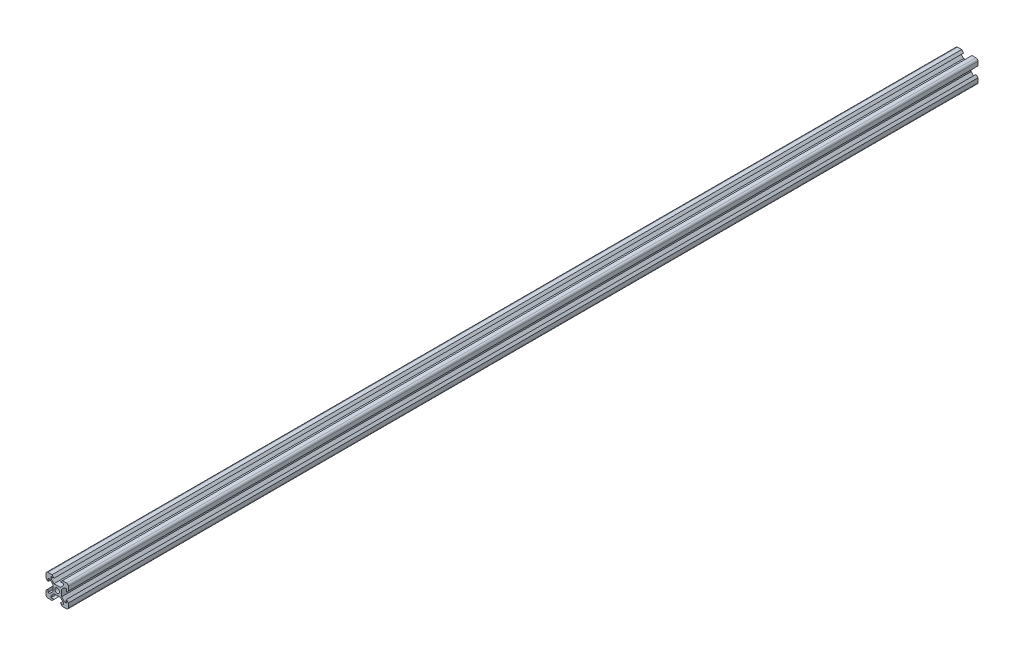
ISO-10303-21;
HEADER;
FILE_DESCRIPTION(('STEP AP214'),'2;1');
FILE_NAME('part.step','',(''),(''),'','','');
FILE_SCHEMA(('AUTOMOTIVE_DESIGN { 1 0 10303 214 1 1 1 1 }'));
ENDSEC;
DATA;
#1=APPLICATION_CONTEXT('core data for automotive mechanical design processes');
#2=APPLICATION_PROTOCOL_DEFINITION('international standard','automotive_design',2000,#1);
#3=PRODUCT_CONTEXT('',#1,'mechanical');
#4=PRODUCT('Part','Part','',(#3));
#5=PRODUCT_RELATED_PRODUCT_CATEGORY('part','',(#4));
#6=PRODUCT_DEFINITION_FORMATION('','',#4);
#7=PRODUCT_DEFINITION_CONTEXT('part definition',#1,'design');
#8=PRODUCT_DEFINITION('design','',#6,#7);
#9=PRODUCT_DEFINITION_SHAPE('','',#8);
#10=(LENGTH_UNIT() NAMED_UNIT(*) SI_UNIT(.MILLI.,.METRE.));
#11=(NAMED_UNIT(*) PLANE_ANGLE_UNIT() SI_UNIT($,.RADIAN.));
#12=(NAMED_UNIT(*) SI_UNIT($,.STERADIAN.) SOLID_ANGLE_UNIT());
#13=UNCERTAINTY_MEASURE_WITH_UNIT(LENGTH_MEASURE(1.E-05),#10,'distance_accuracy_value','');
#14=(GEOMETRIC_REPRESENTATION_CONTEXT(3) GLOBAL_UNCERTAINTY_ASSIGNED_CONTEXT((#13)) GLOBAL_UNIT_ASSIGNED_CONTEXT((#10,
#11,#12)) REPRESENTATION_CONTEXT('',''));
#15=CARTESIAN_POINT('',(0.,0.,0.));
#16=DIRECTION('',(0.,0.,1.));
#17=DIRECTION('',(1.,0.,0.));
#18=AXIS2_PLACEMENT_3D('',#15,#16,#17);
#19=CARTESIAN_POINT('',(8.2,8.2,0.));
#20=DIRECTION('',(0.,1.,0.));
#21=DIRECTION('',(0.707106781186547,0.,0.707106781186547));
#22=AXIS2_PLACEMENT_3D('',#19,#20,#21);
#23=PLANE('',#22);
#24=DIRECTION('',(-1.,0.,0.));
#25=VECTOR('',#24,1.);
#26=CARTESIAN_POINT('',(4.1,8.2,25.4));
#27=LINE('',#26,#25);
#28=CARTESIAN_POINT('',(8.2,8.2,25.4));
#29=VERTEX_POINT('',#28);
#30=CARTESIAN_POINT('',(6.65048164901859,8.2,25.4));
#31=VERTEX_POINT('',#30);
#32=EDGE_CURVE('E11',#29,#31,#27,.T.);
#33=ORIENTED_EDGE('',*,*,#32,.T.);
#34=DIRECTION('',(0.,0.,1.));
#35=VECTOR('',#34,1.);
#36=CARTESIAN_POINT('',(6.65048164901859,8.2,0.));
#37=LINE('',#36,#35);
#38=CARTESIAN_POINT('',(6.65048164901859,8.2,0.));
#39=VERTEX_POINT('',#38);
#40=EDGE_CURVE('E645',#39,#31,#37,.T.);
#41=ORIENTED_EDGE('',*,*,#40,.F.);
#42=DIRECTION('',(-1.,0.,0.));
#43=VECTOR('',#42,1.);
#44=CARTESIAN_POINT('',(4.1,8.2,0.));
#45=LINE('',#44,#43);
#46=CARTESIAN_POINT('',(8.2,8.2,0.));
#47=VERTEX_POINT('',#46);
#48=EDGE_CURVE('E56',#47,#39,#45,.T.);
#49=ORIENTED_EDGE('',*,*,#48,.F.);
#50=DIRECTION('',(0.,0.,1.));
#51=VECTOR('',#50,1.);
#52=CARTESIAN_POINT('',(8.2,8.2,0.));
#53=LINE('',#52,#51);
#54=EDGE_CURVE('E47',#47,#29,#53,.T.);
#55=ORIENTED_EDGE('',*,*,#54,.T.);
#56=EDGE_LOOP('',(#33,#41,#49,#55));
#57=FACE_BOUND('',#56,.T.);
#58=ADVANCED_FACE('F37',(#57),#23,.F.);
#59=CARTESIAN_POINT('',(6.65048164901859,8.2,0.));
#60=DIRECTION('',(-1.,0.,0.));
#61=DIRECTION('',(0.,0.707106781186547,0.707106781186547));
#62=AXIS2_PLACEMENT_3D('',#59,#60,#61);
#63=PLANE('',#62);
#64=DIRECTION('',(0.,-1.,0.));
#65=VECTOR('',#64,1.);
#66=CARTESIAN_POINT('',(6.65048164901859,4.1,25.4));
#67=LINE('',#66,#65);
#68=CARTESIAN_POINT('',(6.65048164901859,7.62066017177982,25.4));
#69=VERTEX_POINT('',#68);
#70=EDGE_CURVE('E285',#31,#69,#67,.T.);
#71=ORIENTED_EDGE('',*,*,#70,.T.);
#72=DIRECTION('',(0.,0.,1.));
#73=VECTOR('',#72,1.);
#74=CARTESIAN_POINT('',(6.65048164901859,7.62066017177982,0.));
#75=LINE('',#74,#73);
#76=CARTESIAN_POINT('',(6.65048164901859,7.62066017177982,0.));
#77=VERTEX_POINT('',#76);
#78=EDGE_CURVE('E654',#77,#69,#75,.T.);
#79=ORIENTED_EDGE('',*,*,#78,.F.);
#80=DIRECTION('',(0.,-1.,0.));
#81=VECTOR('',#80,1.);
#82=CARTESIAN_POINT('',(6.65048164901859,4.1,0.));
#83=LINE('',#82,#81);
#84=EDGE_CURVE('E650',#39,#77,#83,.T.);
#85=ORIENTED_EDGE('',*,*,#84,.F.);
#86=ORIENTED_EDGE('',*,*,#40,.T.);
#87=EDGE_LOOP('',(#71,#79,#85,#86));
#88=FACE_BOUND('',#87,.T.);
#89=ADVANCED_FACE('F1119',(#88),#63,.F.);
#90=CARTESIAN_POINT('',(-6.65048164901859,7.62066017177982,0.));
#91=DIRECTION('',(1.,0.,0.));
#92=DIRECTION('',(0.,0.707106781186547,0.707106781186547));
#93=AXIS2_PLACEMENT_3D('',#90,#91,#92);
#94=PLANE('',#93);
#95=DIRECTION('',(0.,1.,0.));
#96=VECTOR('',#95,1.);
#97=CARTESIAN_POINT('',(-6.65048164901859,3.81033008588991,25.4));
#98=LINE('',#97,#96);
#99=CARTESIAN_POINT('',(-6.65048164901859,7.62066017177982,25.4));
#100=VERTEX_POINT('',#99);
#101=CARTESIAN_POINT('',(-6.65048164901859,8.2,25.4));
#102=VERTEX_POINT('',#101);
#103=EDGE_CURVE('E647',#100,#102,#98,.T.);
#104=ORIENTED_EDGE('',*,*,#103,.T.);
#105=DIRECTION('',(0.,0.,1.));
#106=VECTOR('',#105,1.);
#107=CARTESIAN_POINT('',(-6.65048164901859,8.2,0.));
#108=LINE('',#107,#106);
#109=CARTESIAN_POINT('',(-6.65048164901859,8.2,0.));
#110=VERTEX_POINT('',#109);
#111=EDGE_CURVE('E662',#110,#102,#108,.T.);
#112=ORIENTED_EDGE('',*,*,#111,.F.);
#113=DIRECTION('',(0.,1.,0.));
#114=VECTOR('',#113,1.);
#115=CARTESIAN_POINT('',(-6.65048164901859,3.81033008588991,0.));
#116=LINE('',#115,#114);
#117=CARTESIAN_POINT('',(-6.65048164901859,7.62066017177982,0.));
#118=VERTEX_POINT('',#117);
#119=EDGE_CURVE('E667',#118,#110,#116,.T.);
#120=ORIENTED_EDGE('',*,*,#119,.F.);
#121=DIRECTION('',(0.,0.,1.));
#122=VECTOR('',#121,1.);
#123=CARTESIAN_POINT('',(-6.65048164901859,7.62066017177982,0.));
#124=LINE('',#123,#122);
#125=EDGE_CURVE('E661',#118,#100,#124,.T.);
#126=ORIENTED_EDGE('',*,*,#125,.T.);
#127=EDGE_LOOP('',(#104,#112,#120,#126));
#128=FACE_BOUND('',#127,.T.);
#129=ADVANCED_FACE('F1125',(#128),#94,.F.);
#130=CARTESIAN_POINT('',(-6.65048164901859,8.2,0.));
#131=DIRECTION('',(0.,1.,0.));
#132=DIRECTION('',(0.707106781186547,0.,0.707106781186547));
#133=AXIS2_PLACEMENT_3D('',#130,#131,#132);
#134=PLANE('',#133);
#135=DIRECTION('',(-1.,0.,0.));
#136=VECTOR('',#135,1.);
#137=CARTESIAN_POINT('',(-3.32524082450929,8.2,25.4));
#138=LINE('',#137,#136);
#139=CARTESIAN_POINT('',(-8.2,8.2,25.4));
#140=VERTEX_POINT('',#139);
#141=EDGE_CURVE('E665',#102,#140,#138,.T.);
#142=ORIENTED_EDGE('',*,*,#141,.T.);
#143=DIRECTION('',(0.,0.,1.));
#144=VECTOR('',#143,1.);
#145=CARTESIAN_POINT('',(-8.2,8.2,0.));
#146=LINE('',#145,#144);
#147=CARTESIAN_POINT('',(-8.2,8.2,0.));
#148=VERTEX_POINT('',#147);
#149=EDGE_CURVE('E675',#148,#140,#146,.T.);
#150=ORIENTED_EDGE('',*,*,#149,.F.);
#151=DIRECTION('',(-1.,0.,0.));
#152=VECTOR('',#151,1.);
#153=CARTESIAN_POINT('',(-3.32524082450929,8.2,0.));
#154=LINE('',#153,#152);
#155=EDGE_CURVE('E670',#110,#148,#154,.T.);
#156=ORIENTED_EDGE('',*,*,#155,.F.);
#157=ORIENTED_EDGE('',*,*,#111,.T.);
#158=EDGE_LOOP('',(#142,#150,#156,#157));
#159=FACE_BOUND('',#158,.T.);
#160=ADVANCED_FACE('F1134',(#159),#134,.F.);
#161=CARTESIAN_POINT('',(6.65048164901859,-7.62066017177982,0.));
#162=DIRECTION('',(-1.,0.,0.));
#163=DIRECTION('',(0.,0.707106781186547,0.707106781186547));
#164=AXIS2_PLACEMENT_3D('',#161,#162,#163);
#165=PLANE('',#164);
#166=DIRECTION('',(0.,-1.,0.));
#167=VECTOR('',#166,1.);
#168=CARTESIAN_POINT('',(6.65048164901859,-3.81033008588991,25.4));
#169=LINE('',#168,#167);
#170=CARTESIAN_POINT('',(6.65048164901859,-7.62066017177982,25.4));
#171=VERTEX_POINT('',#170);
#172=CARTESIAN_POINT('',(6.65048164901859,-8.2,25.4));
#173=VERTEX_POINT('',#172);
#174=EDGE_CURVE('E666',#171,#173,#169,.T.);
#175=ORIENTED_EDGE('',*,*,#174,.T.);
#176=DIRECTION('',(0.,0.,1.));
#177=VECTOR('',#176,1.);
#178=CARTESIAN_POINT('',(6.65048164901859,-8.2,0.));
#179=LINE('',#178,#177);
#180=CARTESIAN_POINT('',(6.65048164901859,-8.2,0.));
#181=VERTEX_POINT('',#180);
#182=EDGE_CURVE('E685',#181,#173,#179,.T.);
#183=ORIENTED_EDGE('',*,*,#182,.F.);
#184=DIRECTION('',(0.,-1.,0.));
#185=VECTOR('',#184,1.);
#186=CARTESIAN_POINT('',(6.65048164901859,-3.81033008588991,0.));
#187=LINE('',#186,#185);
#188=CARTESIAN_POINT('',(6.65048164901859,-7.62066017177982,0.));
#189=VERTEX_POINT('',#188);
#190=EDGE_CURVE('E690',#189,#181,#187,.T.);
#191=ORIENTED_EDGE('',*,*,#190,.F.);
#192=DIRECTION('',(0.,0.,1.));
#193=VECTOR('',#192,1.);
#194=CARTESIAN_POINT('',(6.65048164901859,-7.62066017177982,0.));
#195=LINE('',#194,#193);
#196=EDGE_CURVE('E684',#189,#171,#195,.T.);
#197=ORIENTED_EDGE('',*,*,#196,.T.);
#198=EDGE_LOOP('',(#175,#183,#191,#197));
#199=FACE_BOUND('',#198,.T.);
#200=ADVANCED_FACE('F1138',(#199),#165,.F.);
#201=CARTESIAN_POINT('',(6.65048164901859,-8.2,0.));
#202=DIRECTION('',(0.,-1.,0.));
#203=DIRECTION('',(0.707106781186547,0.,0.707106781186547));
#204=AXIS2_PLACEMENT_3D('',#201,#202,#203);
#205=PLANE('',#204);
#206=DIRECTION('',(1.,0.,0.));
#207=VECTOR('',#206,1.);
#208=CARTESIAN_POINT('',(3.32524082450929,-8.2,25.4));
#209=LINE('',#208,#207);
#210=CARTESIAN_POINT('',(8.2,-8.2,25.4));
#211=VERTEX_POINT('',#210);
#212=EDGE_CURVE('E688',#173,#211,#209,.T.);
#213=ORIENTED_EDGE('',*,*,#212,.T.);
#214=DIRECTION('',(0.,0.,1.));
#215=VECTOR('',#214,1.);
#216=CARTESIAN_POINT('',(8.2,-8.2,0.));
#217=LINE('',#216,#215);
#218=CARTESIAN_POINT('',(8.2,-8.2,0.));
#219=VERTEX_POINT('',#218);
#220=EDGE_CURVE('E698',#219,#211,#217,.T.);
#221=ORIENTED_EDGE('',*,*,#220,.F.);
#222=DIRECTION('',(1.,0.,0.));
#223=VECTOR('',#222,1.);
#224=CARTESIAN_POINT('',(3.32524082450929,-8.2,0.));
#225=LINE('',#224,#223);
#226=EDGE_CURVE('E693',#181,#219,#225,.T.);
#227=ORIENTED_EDGE('',*,*,#226,.F.);
#228=ORIENTED_EDGE('',*,*,#182,.T.);
#229=EDGE_LOOP('',(#213,#221,#227,#228));
#230=FACE_BOUND('',#229,.T.);
#231=ADVANCED_FACE('F1142',(#230),#205,.F.);
#232=CARTESIAN_POINT('',(-8.2,-8.2,0.));
#233=DIRECTION('',(0.,-1.,0.));
#234=DIRECTION('',(0.707106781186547,0.,0.707106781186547));
#235=AXIS2_PLACEMENT_3D('',#232,#233,#234);
#236=PLANE('',#235);
#237=DIRECTION('',(1.,0.,0.));
#238=VECTOR('',#237,1.);
#239=CARTESIAN_POINT('',(-4.1,-8.2,25.4));
#240=LINE('',#239,#238);
#241=CARTESIAN_POINT('',(-8.2,-8.2,25.4));
#242=VERTEX_POINT('',#241);
#243=CARTESIAN_POINT('',(-6.65048164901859,-8.2,25.4));
#244=VERTEX_POINT('',#243);
#245=EDGE_CURVE('E689',#242,#244,#240,.T.);
#246=ORIENTED_EDGE('',*,*,#245,.T.);
#247=DIRECTION('',(0.,0.,1.));
#248=VECTOR('',#247,1.);
#249=CARTESIAN_POINT('',(-6.65048164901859,-8.2,0.));
#250=LINE('',#249,#248);
#251=CARTESIAN_POINT('',(-6.65048164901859,-8.2,0.));
#252=VERTEX_POINT('',#251);
#253=EDGE_CURVE('E708',#252,#244,#250,.T.);
#254=ORIENTED_EDGE('',*,*,#253,.F.);
#255=DIRECTION('',(1.,0.,0.));
#256=VECTOR('',#255,1.);
#257=CARTESIAN_POINT('',(-4.1,-8.2,0.));
#258=LINE('',#257,#256);
#259=CARTESIAN_POINT('',(-8.2,-8.2,0.));
#260=VERTEX_POINT('',#259);
#261=EDGE_CURVE('E713',#260,#252,#258,.T.);
#262=ORIENTED_EDGE('',*,*,#261,.F.);
#263=DIRECTION('',(0.,0.,1.));
#264=VECTOR('',#263,1.);
#265=CARTESIAN_POINT('',(-8.2,-8.2,0.));
#266=LINE('',#265,#264);
#267=EDGE_CURVE('E707',#260,#242,#266,.T.);
#268=ORIENTED_EDGE('',*,*,#267,.T.);
#269=EDGE_LOOP('',(#246,#254,#262,#268));
#270=FACE_BOUND('',#269,.T.);
#271=ADVANCED_FACE('F1146',(#270),#236,.F.);
#272=CARTESIAN_POINT('',(-6.65048164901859,-8.2,0.));
#273=DIRECTION('',(1.,0.,0.));
#274=DIRECTION('',(0.,0.707106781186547,0.707106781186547));
#275=AXIS2_PLACEMENT_3D('',#272,#273,#274);
#276=PLANE('',#275);
#277=DIRECTION('',(0.,1.,0.));
#278=VECTOR('',#277,1.);
#279=CARTESIAN_POINT('',(-6.65048164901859,-4.1,25.4));
#280=LINE('',#279,#278);
#281=CARTESIAN_POINT('',(-6.65048164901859,-7.62066017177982,25.4));
#282=VERTEX_POINT('',#281);
#283=EDGE_CURVE('E711',#244,#282,#280,.T.);
#284=ORIENTED_EDGE('',*,*,#283,.T.);
#285=DIRECTION('',(0.,0.,1.));
#286=VECTOR('',#285,1.);
#287=CARTESIAN_POINT('',(-6.65048164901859,-7.62066017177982,0.));
#288=LINE('',#287,#286);
#289=CARTESIAN_POINT('',(-6.65048164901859,-7.62066017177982,0.));
#290=VERTEX_POINT('',#289);
#291=EDGE_CURVE('E721',#290,#282,#288,.T.);
#292=ORIENTED_EDGE('',*,*,#291,.F.);
#293=DIRECTION('',(0.,1.,0.));
#294=VECTOR('',#293,1.);
#295=CARTESIAN_POINT('',(-6.65048164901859,-4.1,0.));
#296=LINE('',#295,#294);
#297=EDGE_CURVE('E716',#252,#290,#296,.T.);
#298=ORIENTED_EDGE('',*,*,#297,.F.);
#299=ORIENTED_EDGE('',*,*,#253,.T.);
#300=EDGE_LOOP('',(#284,#292,#298,#299));
#301=FACE_BOUND('',#300,.T.);
#302=ADVANCED_FACE('F1150',(#301),#276,.F.);
#303=CARTESIAN_POINT('',(5.49933982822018,8.2,0.));
#304=DIRECTION('',(-1.,0.,0.));
#305=DIRECTION('',(0.,0.707106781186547,0.707106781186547));
#306=AXIS2_PLACEMENT_3D('',#303,#304,#305);
#307=PLANE('',#306);
#308=DIRECTION('',(0.,0.,1.));
#309=VECTOR('',#308,1.);
#310=CARTESIAN_POINT('',(5.49933982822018,6.56,0.));
#311=LINE('',#310,#309);
#312=CARTESIAN_POINT('',(5.49933982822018,6.56,0.));
#313=VERTEX_POINT('',#312);
#314=CARTESIAN_POINT('',(5.49933982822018,6.56,812.8));
#315=VERTEX_POINT('',#314);
#316=EDGE_CURVE('E712',#313,#315,#311,.T.);
#317=ORIENTED_EDGE('',*,*,#316,.T.);
#318=DIRECTION('',(0.,-1.,0.));
#319=VECTOR('',#318,1.);
#320=CARTESIAN_POINT('',(5.49933982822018,8.2,812.8));
#321=LINE('',#320,#319);
#322=CARTESIAN_POINT('',(5.49933982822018,8.2,812.8));
#323=VERTEX_POINT('',#322);
#324=EDGE_CURVE('E578',#323,#315,#321,.T.);
#325=ORIENTED_EDGE('',*,*,#324,.F.);
#326=DIRECTION('',(0.,0.,1.));
#327=VECTOR('',#326,1.);
#328=CARTESIAN_POINT('',(5.49933982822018,8.2,0.));
#329=LINE('',#328,#327);
#330=CARTESIAN_POINT('',(5.49933982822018,8.2,0.));
#331=VERTEX_POINT('',#330);
#332=EDGE_CURVE('E728',#331,#323,#329,.T.);
#333=ORIENTED_EDGE('',*,*,#332,.F.);
#334=DIRECTION('',(0.,1.,0.));
#335=VECTOR('',#334,1.);
#336=CARTESIAN_POINT('',(5.49933982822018,4.1,0.));
#337=LINE('',#336,#335);
#338=EDGE_CURVE('E731',#313,#331,#337,.T.);
#339=ORIENTED_EDGE('',*,*,#338,.F.);
#340=EDGE_LOOP('',(#317,#325,#333,#339));
#341=FACE_BOUND('',#340,.T.);
#342=ADVANCED_FACE('F992',(#341),#307,.T.);
#343=CARTESIAN_POINT('',(2.79514604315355,8.2,0.));
#344=DIRECTION('',(0.,-1.,0.));
#345=DIRECTION('',(0.707106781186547,0.,0.707106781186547));
#346=AXIS2_PLACEMENT_3D('',#343,#344,#345);
#347=PLANE('',#346);
#348=ORIENTED_EDGE('',*,*,#332,.T.);
#349=DIRECTION('',(1.,0.,0.));
#350=VECTOR('',#349,1.);
#351=CARTESIAN_POINT('',(2.79514604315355,8.2,812.8));
#352=LINE('',#351,#350);
#353=CARTESIAN_POINT('',(2.79514604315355,8.2,812.8));
#354=VERTEX_POINT('',#353);
#355=EDGE_CURVE('E575',#354,#323,#352,.T.);
#356=ORIENTED_EDGE('',*,*,#355,.F.);
#357=DIRECTION('',(0.,0.,1.));
#358=VECTOR('',#357,1.);
#359=CARTESIAN_POINT('',(2.79514604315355,8.2,0.));
#360=LINE('',#359,#358);
#361=CARTESIAN_POINT('',(2.79514604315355,8.2,0.));
#362=VERTEX_POINT('',#361);
#363=EDGE_CURVE('E730',#362,#354,#360,.T.);
#364=ORIENTED_EDGE('',*,*,#363,.F.);
#365=DIRECTION('',(-1.,0.,0.));
#366=VECTOR('',#365,1.);
#367=CARTESIAN_POINT('',(1.39757302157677,8.2,0.));
#368=LINE('',#367,#366);
#369=EDGE_CURVE('E733',#331,#362,#368,.T.);
#370=ORIENTED_EDGE('',*,*,#369,.F.);
#371=EDGE_LOOP('',(#348,#356,#364,#370));
#372=FACE_BOUND('',#371,.T.);
#373=ADVANCED_FACE('F998',(#372),#347,.T.);
#374=CARTESIAN_POINT('',(4.59514604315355,10.,0.));
#375=DIRECTION('',(-0.707106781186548,0.707106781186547,0.));
#376=DIRECTION('',(0.577350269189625,0.577350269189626,0.577350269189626));
#377=AXIS2_PLACEMENT_3D('',#374,#375,#376);
#378=PLANE('',#377);
#379=ORIENTED_EDGE('',*,*,#363,.T.);
#380=DIRECTION('',(-0.707106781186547,-0.707106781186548,0.));
#381=VECTOR('',#380,1.);
#382=CARTESIAN_POINT('',(4.59514604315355,10.,812.8));
#383=LINE('',#382,#381);
#384=CARTESIAN_POINT('',(4.59514604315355,10.,812.8));
#385=VERTEX_POINT('',#384);
#386=EDGE_CURVE('E572',#385,#354,#383,.T.);
#387=ORIENTED_EDGE('',*,*,#386,.F.);
#388=DIRECTION('',(0.,0.,1.));
#389=VECTOR('',#388,1.);
#390=CARTESIAN_POINT('',(4.59514604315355,10.,0.));
#391=LINE('',#390,#389);
#392=CARTESIAN_POINT('',(4.59514604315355,10.,0.));
#393=VERTEX_POINT('',#392);
#394=EDGE_CURVE('E736',#393,#385,#391,.T.);
#395=ORIENTED_EDGE('',*,*,#394,.F.);
#396=DIRECTION('',(0.707106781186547,0.707106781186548,0.));
#397=VECTOR('',#396,1.);
#398=CARTESIAN_POINT('',(0.946359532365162,6.35121348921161,0.));
#399=LINE('',#398,#397);
#400=EDGE_CURVE('E738',#362,#393,#399,.T.);
#401=ORIENTED_EDGE('',*,*,#400,.F.);
#402=EDGE_LOOP('',(#379,#387,#395,#401));
#403=FACE_BOUND('',#402,.T.);
#404=ADVANCED_FACE('F1005',(#403),#378,.T.);
#405=CARTESIAN_POINT('',(8.2,10.,0.));
#406=DIRECTION('',(0.,1.,0.));
#407=DIRECTION('',(0.707106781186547,0.,0.707106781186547));
#408=AXIS2_PLACEMENT_3D('',#405,#406,#407);
#409=PLANE('',#408);
#410=ORIENTED_EDGE('',*,*,#394,.T.);
#411=DIRECTION('',(-1.,0.,0.));
#412=VECTOR('',#411,1.);
#413=CARTESIAN_POINT('',(8.2,10.,812.8));
#414=LINE('',#413,#412);
#415=CARTESIAN_POINT('',(8.2,10.,812.8));
#416=VERTEX_POINT('',#415);
#417=EDGE_CURVE('E569',#416,#385,#414,.T.);
#418=ORIENTED_EDGE('',*,*,#417,.F.);
#419=DIRECTION('',(0.,0.,1.));
#420=VECTOR('',#419,1.);
#421=CARTESIAN_POINT('',(8.2,10.,0.));
#422=LINE('',#421,#420);
#423=CARTESIAN_POINT('',(8.2,10.,0.));
#424=VERTEX_POINT('',#423);
#425=EDGE_CURVE('E740',#424,#416,#422,.T.);
#426=ORIENTED_EDGE('',*,*,#425,.F.);
#427=DIRECTION('',(1.,0.,0.));
#428=VECTOR('',#427,1.);
#429=CARTESIAN_POINT('',(4.1,10.,0.));
#430=LINE('',#429,#428);
#431=EDGE_CURVE('E742',#393,#424,#430,.T.);
#432=ORIENTED_EDGE('',*,*,#431,.F.);
#433=EDGE_LOOP('',(#410,#418,#426,#432));
#434=FACE_BOUND('',#433,.T.);
#435=ADVANCED_FACE('F1008',(#434),#409,.T.);
#436=CARTESIAN_POINT('',(8.2,8.2,0.));
#437=DIRECTION('',(0.,0.,1.));
#438=DIRECTION('',(1.,0.,0.));
#439=AXIS2_PLACEMENT_3D('',#436,#437,#438);
#440=CYLINDRICAL_SURFACE('',#439,1.8);
#441=ORIENTED_EDGE('',*,*,#425,.T.);
#442=CARTESIAN_POINT('',(8.2,8.2,812.8));
#443=DIRECTION('',(0.,0.,1.));
#444=DIRECTION('',(1.,0.,0.));
#445=AXIS2_PLACEMENT_3D('',#442,#443,#444);
#446=CIRCLE('',#445,1.8);
#447=CARTESIAN_POINT('',(10.,8.2,812.8));
#448=VERTEX_POINT('',#447);
#449=EDGE_CURVE('E566',#448,#416,#446,.T.);
#450=ORIENTED_EDGE('',*,*,#449,.F.);
#451=DIRECTION('',(0.,0.,1.));
#452=VECTOR('',#451,1.);
#453=CARTESIAN_POINT('',(10.,8.2,0.));
#454=LINE('',#453,#452);
#455=CARTESIAN_POINT('',(10.,8.2,0.));
#456=VERTEX_POINT('',#455);
#457=EDGE_CURVE('E744',#456,#448,#454,.T.);
#458=ORIENTED_EDGE('',*,*,#457,.F.);
#459=CARTESIAN_POINT('',(8.2,8.2,0.));
#460=DIRECTION('',(0.,0.,-1.));
#461=DIRECTION('',(1.,0.,0.));
#462=AXIS2_PLACEMENT_3D('',#459,#460,#461);
#463=CIRCLE('',#462,1.8);
#464=EDGE_CURVE('E746',#424,#456,#463,.T.);
#465=ORIENTED_EDGE('',*,*,#464,.F.);
#466=EDGE_LOOP('',(#441,#450,#458,#465));
#467=FACE_BOUND('',#466,.T.);
#468=ADVANCED_FACE('F1013',(#467),#440,.T.);
#469=CARTESIAN_POINT('',(10.,4.59514604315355,0.));
#470=DIRECTION('',(1.,0.,0.));
#471=DIRECTION('',(0.,0.707106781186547,0.707106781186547));
#472=AXIS2_PLACEMENT_3D('',#469,#470,#471);
#473=PLANE('',#472);
#474=ORIENTED_EDGE('',*,*,#457,.T.);
#475=DIRECTION('',(0.,1.,0.));
#476=VECTOR('',#475,1.);
#477=CARTESIAN_POINT('',(10.,4.59514604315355,812.8));
#478=LINE('',#477,#476);
#479=CARTESIAN_POINT('',(10.,4.59514604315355,812.8));
#480=VERTEX_POINT('',#479);
#481=EDGE_CURVE('E563',#480,#448,#478,.T.);
#482=ORIENTED_EDGE('',*,*,#481,.F.);
#483=DIRECTION('',(0.,0.,1.));
#484=VECTOR('',#483,1.);
#485=CARTESIAN_POINT('',(10.,4.59514604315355,0.));
#486=LINE('',#485,#484);
#487=CARTESIAN_POINT('',(10.,4.59514604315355,0.));
#488=VERTEX_POINT('',#487);
#489=EDGE_CURVE('E748',#488,#480,#486,.T.);
#490=ORIENTED_EDGE('',*,*,#489,.F.);
#491=DIRECTION('',(0.,-1.,0.));
#492=VECTOR('',#491,1.);
#493=CARTESIAN_POINT('',(10.,2.29757302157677,0.));
#494=LINE('',#493,#492);
#495=EDGE_CURVE('E750',#456,#488,#494,.T.);
#496=ORIENTED_EDGE('',*,*,#495,.F.);
#497=EDGE_LOOP('',(#474,#482,#490,#496));
#498=FACE_BOUND('',#497,.T.);
#499=ADVANCED_FACE('F1020',(#498),#473,.T.);
#500=CARTESIAN_POINT('',(8.2,2.79514604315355,0.));
#501=DIRECTION('',(0.707106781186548,-0.707106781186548,0.));
#502=DIRECTION('',(0.577350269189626,0.577350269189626,0.577350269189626));
#503=AXIS2_PLACEMENT_3D('',#500,#501,#502);
#504=PLANE('',#503);
#505=ORIENTED_EDGE('',*,*,#489,.T.);
#506=DIRECTION('',(0.707106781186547,0.707106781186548,0.));
#507=VECTOR('',#506,1.);
#508=CARTESIAN_POINT('',(8.2,2.79514604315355,812.8));
#509=LINE('',#508,#507);
#510=CARTESIAN_POINT('',(8.2,2.79514604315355,812.8));
#511=VERTEX_POINT('',#510);
#512=EDGE_CURVE('E560',#511,#480,#509,.T.);
#513=ORIENTED_EDGE('',*,*,#512,.F.);
#514=DIRECTION('',(0.,0.,1.));
#515=VECTOR('',#514,1.);
#516=CARTESIAN_POINT('',(8.2,2.79514604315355,0.));
#517=LINE('',#516,#515);
#518=CARTESIAN_POINT('',(8.2,2.79514604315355,0.));
#519=VERTEX_POINT('',#518);
#520=EDGE_CURVE('E752',#519,#511,#517,.T.);
#521=ORIENTED_EDGE('',*,*,#520,.F.);
#522=DIRECTION('',(-0.707106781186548,-0.707106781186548,0.));
#523=VECTOR('',#522,1.);
#524=CARTESIAN_POINT('',(5.45121348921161,0.0463595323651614,0.));
#525=LINE('',#524,#523);
#526=EDGE_CURVE('E754',#488,#519,#525,.T.);
#527=ORIENTED_EDGE('',*,*,#526,.F.);
#528=EDGE_LOOP('',(#505,#513,#521,#527));
#529=FACE_BOUND('',#528,.T.);
#530=ADVANCED_FACE('F1023',(#529),#504,.T.);
#531=CARTESIAN_POINT('',(8.2,5.49933982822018,0.));
#532=DIRECTION('',(-1.,0.,0.));
#533=DIRECTION('',(0.,0.707106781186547,0.707106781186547));
#534=AXIS2_PLACEMENT_3D('',#531,#532,#533);
#535=PLANE('',#534);
#536=ORIENTED_EDGE('',*,*,#520,.T.);
#537=DIRECTION('',(0.,-1.,0.));
#538=VECTOR('',#537,1.);
#539=CARTESIAN_POINT('',(8.2,5.49933982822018,812.8));
#540=LINE('',#539,#538);
#541=CARTESIAN_POINT('',(8.2,5.49933982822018,812.8));
#542=VERTEX_POINT('',#541);
#543=EDGE_CURVE('E557',#542,#511,#540,.T.);
#544=ORIENTED_EDGE('',*,*,#543,.F.);
#545=DIRECTION('',(0.,0.,1.));
#546=VECTOR('',#545,1.);
#547=CARTESIAN_POINT('',(8.2,5.49933982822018,0.));
#548=LINE('',#547,#546);
#549=CARTESIAN_POINT('',(8.2,5.49933982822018,0.));
#550=VERTEX_POINT('',#549);
#551=EDGE_CURVE('E756',#550,#542,#548,.T.);
#552=ORIENTED_EDGE('',*,*,#551,.F.);
#553=DIRECTION('',(0.,1.,0.));
#554=VECTOR('',#553,1.);
#555=CARTESIAN_POINT('',(8.2,2.74966991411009,0.));
#556=LINE('',#555,#554);
#557=EDGE_CURVE('E758',#519,#550,#556,.T.);
#558=ORIENTED_EDGE('',*,*,#557,.F.);
#559=EDGE_LOOP('',(#536,#544,#552,#558));
#560=FACE_BOUND('',#559,.T.);
#561=ADVANCED_FACE('F1028',(#560),#535,.T.);
#562=CARTESIAN_POINT('',(6.56,5.49933982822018,0.));
#563=DIRECTION('',(0.,-1.,0.));
#564=DIRECTION('',(0.707106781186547,0.,0.707106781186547));
#565=AXIS2_PLACEMENT_3D('',#562,#563,#564);
#566=PLANE('',#565);
#567=ORIENTED_EDGE('',*,*,#551,.T.);
#568=DIRECTION('',(1.,0.,0.));
#569=VECTOR('',#568,1.);
#570=CARTESIAN_POINT('',(6.56,5.49933982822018,812.8));
#571=LINE('',#570,#569);
#572=CARTESIAN_POINT('',(6.56,5.49933982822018,812.8));
#573=VERTEX_POINT('',#572);
#574=EDGE_CURVE('E554',#573,#542,#571,.T.);
#575=ORIENTED_EDGE('',*,*,#574,.F.);
#576=DIRECTION('',(0.,0.,1.));
#577=VECTOR('',#576,1.);
#578=CARTESIAN_POINT('',(6.56,5.49933982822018,0.));
#579=LINE('',#578,#577);
#580=CARTESIAN_POINT('',(6.56,5.49933982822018,0.));
#581=VERTEX_POINT('',#580);
#582=EDGE_CURVE('E760',#581,#573,#579,.T.);
#583=ORIENTED_EDGE('',*,*,#582,.F.);
#584=DIRECTION('',(-1.,0.,0.));
#585=VECTOR('',#584,1.);
#586=CARTESIAN_POINT('',(3.28,5.49933982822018,0.));
#587=LINE('',#586,#585);
#588=EDGE_CURVE('E762',#550,#581,#587,.T.);
#589=ORIENTED_EDGE('',*,*,#588,.F.);
#590=EDGE_LOOP('',(#567,#575,#583,#589));
#591=FACE_BOUND('',#590,.T.);
#592=ADVANCED_FACE('F1035',(#591),#566,.T.);
#593=CARTESIAN_POINT('',(3.90066017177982,2.84,0.));
#594=DIRECTION('',(0.707106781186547,-0.707106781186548,0.));
#595=DIRECTION('',(0.577350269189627,0.577350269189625,0.577350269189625));
#596=AXIS2_PLACEMENT_3D('',#593,#594,#595);
#597=PLANE('',#596);
#598=ORIENTED_EDGE('',*,*,#582,.T.);
#599=DIRECTION('',(0.707106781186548,0.707106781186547,0.));
#600=VECTOR('',#599,1.);
#601=CARTESIAN_POINT('',(3.90066017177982,2.84,812.8));
#602=LINE('',#601,#600);
#603=CARTESIAN_POINT('',(3.90066017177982,2.84,812.8));
#604=VERTEX_POINT('',#603);
#605=EDGE_CURVE('E551',#604,#573,#602,.T.);
#606=ORIENTED_EDGE('',*,*,#605,.F.);
#607=DIRECTION('',(0.,0.,1.));
#608=VECTOR('',#607,1.);
#609=CARTESIAN_POINT('',(3.90066017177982,2.84,0.));
#610=LINE('',#609,#608);
#611=CARTESIAN_POINT('',(3.90066017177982,2.84,0.));
#612=VERTEX_POINT('',#611);
#613=EDGE_CURVE('E764',#612,#604,#610,.T.);
#614=ORIENTED_EDGE('',*,*,#613,.F.);
#615=DIRECTION('',(-0.707106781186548,-0.707106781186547,0.));
#616=VECTOR('',#615,1.);
#617=CARTESIAN_POINT('',(2.21549512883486,1.15483495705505,0.));
#618=LINE('',#617,#616);
#619=EDGE_CURVE('E766',#581,#612,#618,.T.);
#620=ORIENTED_EDGE('',*,*,#619,.F.);
#621=EDGE_LOOP('',(#598,#606,#614,#620));
#622=FACE_BOUND('',#621,.T.);
#623=ADVANCED_FACE('F1038',(#622),#597,.T.);
#624=CARTESIAN_POINT('',(3.90066017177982,-2.84,0.));
#625=DIRECTION('',(1.,0.,0.));
#626=DIRECTION('',(0.,0.707106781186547,0.707106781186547));
#627=AXIS2_PLACEMENT_3D('',#624,#625,#626);
#628=PLANE('',#627);
#629=ORIENTED_EDGE('',*,*,#613,.T.);
#630=DIRECTION('',(0.,1.,0.));
#631=VECTOR('',#630,1.);
#632=CARTESIAN_POINT('',(3.90066017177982,-2.84,812.8));
#633=LINE('',#632,#631);
#634=CARTESIAN_POINT('',(3.90066017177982,-2.84,812.8));
#635=VERTEX_POINT('',#634);
#636=EDGE_CURVE('E548',#635,#604,#633,.T.);
#637=ORIENTED_EDGE('',*,*,#636,.F.);
#638=DIRECTION('',(0.,0.,1.));
#639=VECTOR('',#638,1.);
#640=CARTESIAN_POINT('',(3.90066017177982,-2.84,0.));
#641=LINE('',#640,#639);
#642=CARTESIAN_POINT('',(3.90066017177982,-2.84,0.));
#643=VERTEX_POINT('',#642);
#644=EDGE_CURVE('E768',#643,#635,#641,.T.);
#645=ORIENTED_EDGE('',*,*,#644,.F.);
#646=DIRECTION('',(0.,-1.,0.));
#647=VECTOR('',#646,1.);
#648=CARTESIAN_POINT('',(3.90066017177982,-1.42,0.));
#649=LINE('',#648,#647);
#650=EDGE_CURVE('E770',#612,#643,#649,.T.);
#651=ORIENTED_EDGE('',*,*,#650,.F.);
#652=EDGE_LOOP('',(#629,#637,#645,#651));
#653=FACE_BOUND('',#652,.T.);
#654=ADVANCED_FACE('F1043',(#653),#628,.T.);
#655=CARTESIAN_POINT('',(6.56,-5.49933982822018,0.));
#656=DIRECTION('',(0.707106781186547,0.707106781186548,0.));
#657=DIRECTION('',(-0.577350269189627,0.577350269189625,0.577350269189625));
#658=AXIS2_PLACEMENT_3D('',#655,#656,#657);
#659=PLANE('',#658);
#660=ORIENTED_EDGE('',*,*,#644,.T.);
#661=DIRECTION('',(-0.707106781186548,0.707106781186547,0.));
#662=VECTOR('',#661,1.);
#663=CARTESIAN_POINT('',(6.56,-5.49933982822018,812.8));
#664=LINE('',#663,#662);
#665=CARTESIAN_POINT('',(6.56,-5.49933982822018,812.8));
#666=VERTEX_POINT('',#665);
#667=EDGE_CURVE('E545',#666,#635,#664,.T.);
#668=ORIENTED_EDGE('',*,*,#667,.F.);
#669=DIRECTION('',(0.,0.,1.));
#670=VECTOR('',#669,1.);
#671=CARTESIAN_POINT('',(6.56,-5.49933982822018,0.));
#672=LINE('',#671,#670);
#673=CARTESIAN_POINT('',(6.56,-5.49933982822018,0.));
#674=VERTEX_POINT('',#673);
#675=EDGE_CURVE('E772',#674,#666,#672,.T.);
#676=ORIENTED_EDGE('',*,*,#675,.F.);
#677=DIRECTION('',(0.707106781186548,-0.707106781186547,0.));
#678=VECTOR('',#677,1.);
#679=CARTESIAN_POINT('',(3.54516504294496,-2.48450487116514,0.));
#680=LINE('',#679,#678);
#681=EDGE_CURVE('E774',#643,#674,#680,.T.);
#682=ORIENTED_EDGE('',*,*,#681,.F.);
#683=EDGE_LOOP('',(#660,#668,#676,#682));
#684=FACE_BOUND('',#683,.T.);
#685=ADVANCED_FACE('F1050',(#684),#659,.T.);
#686=CARTESIAN_POINT('',(8.2,-5.49933982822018,0.));
#687=DIRECTION('',(0.,1.,0.));
#688=DIRECTION('',(0.707106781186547,0.,0.707106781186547));
#689=AXIS2_PLACEMENT_3D('',#686,#687,#688);
#690=PLANE('',#689);
#691=ORIENTED_EDGE('',*,*,#675,.T.);
#692=DIRECTION('',(-1.,0.,0.));
#693=VECTOR('',#692,1.);
#694=CARTESIAN_POINT('',(8.2,-5.49933982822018,812.8));
#695=LINE('',#694,#693);
#696=CARTESIAN_POINT('',(8.2,-5.49933982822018,812.8));
#697=VERTEX_POINT('',#696);
#698=EDGE_CURVE('E542',#697,#666,#695,.T.);
#699=ORIENTED_EDGE('',*,*,#698,.F.);
#700=DIRECTION('',(0.,0.,1.));
#701=VECTOR('',#700,1.);
#702=CARTESIAN_POINT('',(8.2,-5.49933982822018,0.));
#703=LINE('',#702,#701);
#704=CARTESIAN_POINT('',(8.2,-5.49933982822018,0.));
#705=VERTEX_POINT('',#704);
#706=EDGE_CURVE('E776',#705,#697,#703,.T.);
#707=ORIENTED_EDGE('',*,*,#706,.F.);
#708=DIRECTION('',(1.,0.,0.));
#709=VECTOR('',#708,1.);
#710=CARTESIAN_POINT('',(4.1,-5.49933982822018,0.));
#711=LINE('',#710,#709);
#712=EDGE_CURVE('E778',#674,#705,#711,.T.);
#713=ORIENTED_EDGE('',*,*,#712,.F.);
#714=EDGE_LOOP('',(#691,#699,#707,#713));
#715=FACE_BOUND('',#714,.T.);
#716=ADVANCED_FACE('F1053',(#715),#690,.T.);
#717=CARTESIAN_POINT('',(8.2,-2.79514604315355,0.));
#718=DIRECTION('',(-1.,0.,0.));
#719=DIRECTION('',(0.,0.707106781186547,0.707106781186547));
#720=AXIS2_PLACEMENT_3D('',#717,#718,#719);
#721=PLANE('',#720);
#722=ORIENTED_EDGE('',*,*,#706,.T.);
#723=DIRECTION('',(0.,-1.,0.));
#724=VECTOR('',#723,1.);
#725=CARTESIAN_POINT('',(8.2,-2.79514604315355,812.8));
#726=LINE('',#725,#724);
#727=CARTESIAN_POINT('',(8.2,-2.79514604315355,812.8));
#728=VERTEX_POINT('',#727);
#729=EDGE_CURVE('E539',#728,#697,#726,.T.);
#730=ORIENTED_EDGE('',*,*,#729,.F.);
#731=DIRECTION('',(0.,0.,1.));
#732=VECTOR('',#731,1.);
#733=CARTESIAN_POINT('',(8.2,-2.79514604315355,0.));
#734=LINE('',#733,#732);
#735=CARTESIAN_POINT('',(8.2,-2.79514604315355,0.));
#736=VERTEX_POINT('',#735);
#737=EDGE_CURVE('E780',#736,#728,#734,.T.);
#738=ORIENTED_EDGE('',*,*,#737,.F.);
#739=DIRECTION('',(0.,1.,0.));
#740=VECTOR('',#739,1.);
#741=CARTESIAN_POINT('',(8.2,-1.39757302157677,0.));
#742=LINE('',#741,#740);
#743=EDGE_CURVE('E782',#705,#736,#742,.T.);
#744=ORIENTED_EDGE('',*,*,#743,.F.);
#745=EDGE_LOOP('',(#722,#730,#738,#744));
#746=FACE_BOUND('',#745,.T.);
#747=ADVANCED_FACE('F1058',(#746),#721,.T.);
#748=CARTESIAN_POINT('',(10.,-4.59514604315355,0.));
#749=DIRECTION('',(0.707106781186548,0.707106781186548,0.));
#750=DIRECTION('',(-0.577350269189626,0.577350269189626,0.577350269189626));
#751=AXIS2_PLACEMENT_3D('',#748,#749,#750);
#752=PLANE('',#751);
#753=ORIENTED_EDGE('',*,*,#737,.T.);
#754=DIRECTION('',(-0.707106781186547,0.707106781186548,0.));
#755=VECTOR('',#754,1.);
#756=CARTESIAN_POINT('',(10.,-4.59514604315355,812.8));
#757=LINE('',#756,#755);
#758=CARTESIAN_POINT('',(10.,-4.59514604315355,812.8));
#759=VERTEX_POINT('',#758);
#760=EDGE_CURVE('E536',#759,#728,#757,.T.);
#761=ORIENTED_EDGE('',*,*,#760,.F.);
#762=DIRECTION('',(0.,0.,1.));
#763=VECTOR('',#762,1.);
#764=CARTESIAN_POINT('',(10.,-4.59514604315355,0.));
#765=LINE('',#764,#763);
#766=CARTESIAN_POINT('',(10.,-4.59514604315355,0.));
#767=VERTEX_POINT('',#766);
#768=EDGE_CURVE('E784',#767,#759,#765,.T.);
#769=ORIENTED_EDGE('',*,*,#768,.F.);
#770=DIRECTION('',(0.707106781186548,-0.707106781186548,0.));
#771=VECTOR('',#770,1.);
#772=CARTESIAN_POINT('',(6.35121348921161,-0.946359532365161,0.));
#773=LINE('',#772,#771);
#774=EDGE_CURVE('E786',#736,#767,#773,.T.);
#775=ORIENTED_EDGE('',*,*,#774,.F.);
#776=EDGE_LOOP('',(#753,#761,#769,#775));
#777=FACE_BOUND('',#776,.T.);
#778=ADVANCED_FACE('F1065',(#777),#752,.T.);
#779=CARTESIAN_POINT('',(10.,-8.2,0.));
#780=DIRECTION('',(1.,0.,0.));
#781=DIRECTION('',(0.,0.707106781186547,0.707106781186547));
#782=AXIS2_PLACEMENT_3D('',#779,#780,#781);
#783=PLANE('',#782);
#784=ORIENTED_EDGE('',*,*,#768,.T.);
#785=DIRECTION('',(0.,1.,0.));
#786=VECTOR('',#785,1.);
#787=CARTESIAN_POINT('',(10.,-8.2,812.8));
#788=LINE('',#787,#786);
#789=CARTESIAN_POINT('',(10.,-8.2,812.8));
#790=VERTEX_POINT('',#789);
#791=EDGE_CURVE('E533',#790,#759,#788,.T.);
#792=ORIENTED_EDGE('',*,*,#791,.F.);
#793=DIRECTION('',(0.,0.,1.));
#794=VECTOR('',#793,1.);
#795=CARTESIAN_POINT('',(10.,-8.2,0.));
#796=LINE('',#795,#794);
#797=CARTESIAN_POINT('',(10.,-8.2,0.));
#798=VERTEX_POINT('',#797);
#799=EDGE_CURVE('E788',#798,#790,#796,.T.);
#800=ORIENTED_EDGE('',*,*,#799,.F.);
#801=DIRECTION('',(0.,-1.,0.));
#802=VECTOR('',#801,1.);
#803=CARTESIAN_POINT('',(10.,-4.1,0.));
#804=LINE('',#803,#802);
#805=EDGE_CURVE('E790',#767,#798,#804,.T.);
#806=ORIENTED_EDGE('',*,*,#805,.F.);
#807=EDGE_LOOP('',(#784,#792,#800,#806));
#808=FACE_BOUND('',#807,.T.);
#809=ADVANCED_FACE('F1068',(#808),#783,.T.);
#810=CARTESIAN_POINT('',(8.2,-8.2,0.));
#811=DIRECTION('',(0.,0.,1.));
#812=DIRECTION('',(0.,-1.,0.));
#813=AXIS2_PLACEMENT_3D('',#810,#811,#812);
#814=CYLINDRICAL_SURFACE('',#813,1.8);
#815=ORIENTED_EDGE('',*,*,#799,.T.);
#816=CARTESIAN_POINT('',(8.2,-8.2,812.8));
#817=DIRECTION('',(0.,0.,1.));
#818=DIRECTION('',(1.,0.,0.));
#819=AXIS2_PLACEMENT_3D('',#816,#817,#818);
#820=CIRCLE('',#819,1.8);
#821=CARTESIAN_POINT('',(8.2,-10.,812.8));
#822=VERTEX_POINT('',#821);
#823=EDGE_CURVE('E530',#822,#790,#820,.T.);
#824=ORIENTED_EDGE('',*,*,#823,.F.);
#825=DIRECTION('',(0.,0.,1.));
#826=VECTOR('',#825,1.);
#827=CARTESIAN_POINT('',(8.2,-10.,0.));
#828=LINE('',#827,#826);
#829=CARTESIAN_POINT('',(8.2,-10.,0.));
#830=VERTEX_POINT('',#829);
#831=EDGE_CURVE('E792',#830,#822,#828,.T.);
#832=ORIENTED_EDGE('',*,*,#831,.F.);
#833=CARTESIAN_POINT('',(8.2,-8.2,0.));
#834=DIRECTION('',(0.,0.,-1.));
#835=DIRECTION('',(0.,-1.,0.));
#836=AXIS2_PLACEMENT_3D('',#833,#834,#835);
#837=CIRCLE('',#836,1.8);
#838=EDGE_CURVE('E794',#798,#830,#837,.T.);
#839=ORIENTED_EDGE('',*,*,#838,.F.);
#840=EDGE_LOOP('',(#815,#824,#832,#839));
#841=FACE_BOUND('',#840,.T.);
#842=ADVANCED_FACE('F1073',(#841),#814,.T.);
#843=CARTESIAN_POINT('',(4.59514604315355,-10.,0.));
#844=DIRECTION('',(0.,-1.,0.));
#845=DIRECTION('',(0.707106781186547,0.,0.707106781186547));
#846=AXIS2_PLACEMENT_3D('',#843,#844,#845);
#847=PLANE('',#846);
#848=ORIENTED_EDGE('',*,*,#831,.T.);
#849=DIRECTION('',(1.,0.,0.));
#850=VECTOR('',#849,1.);
#851=CARTESIAN_POINT('',(4.59514604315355,-10.,812.8));
#852=LINE('',#851,#850);
#853=CARTESIAN_POINT('',(4.59514604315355,-10.,812.8));
#854=VERTEX_POINT('',#853);
#855=EDGE_CURVE('E527',#854,#822,#852,.T.);
#856=ORIENTED_EDGE('',*,*,#855,.F.);
#857=DIRECTION('',(0.,0.,1.));
#858=VECTOR('',#857,1.);
#859=CARTESIAN_POINT('',(4.59514604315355,-10.,0.));
#860=LINE('',#859,#858);
#861=CARTESIAN_POINT('',(4.59514604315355,-10.,0.));
#862=VERTEX_POINT('',#861);
#863=EDGE_CURVE('E796',#862,#854,#860,.T.);
#864=ORIENTED_EDGE('',*,*,#863,.F.);
#865=DIRECTION('',(-1.,0.,0.));
#866=VECTOR('',#865,1.);
#867=CARTESIAN_POINT('',(2.29757302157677,-10.,0.));
#868=LINE('',#867,#866);
#869=EDGE_CURVE('E798',#830,#862,#868,.T.);
#870=ORIENTED_EDGE('',*,*,#869,.F.);
#871=EDGE_LOOP('',(#848,#856,#864,#870));
#872=FACE_BOUND('',#871,.T.);
#873=ADVANCED_FACE('F1080',(#872),#847,.T.);
#874=CARTESIAN_POINT('',(2.79514604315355,-8.2,0.));
#875=DIRECTION('',(-0.707106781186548,-0.707106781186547,0.));
#876=DIRECTION('',(-0.577350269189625,0.577350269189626,0.577350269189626));
#877=AXIS2_PLACEMENT_3D('',#874,#875,#876);
#878=PLANE('',#877);
#879=ORIENTED_EDGE('',*,*,#863,.T.);
#880=DIRECTION('',(0.707106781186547,-0.707106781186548,0.));
#881=VECTOR('',#880,1.);
#882=CARTESIAN_POINT('',(2.79514604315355,-8.2,812.8));
#883=LINE('',#882,#881);
#884=CARTESIAN_POINT('',(2.79514604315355,-8.2,812.8));
#885=VERTEX_POINT('',#884);
#886=EDGE_CURVE('E524',#885,#854,#883,.T.);
#887=ORIENTED_EDGE('',*,*,#886,.F.);
#888=DIRECTION('',(0.,0.,1.));
#889=VECTOR('',#888,1.);
#890=CARTESIAN_POINT('',(2.79514604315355,-8.2,0.));
#891=LINE('',#890,#889);
#892=CARTESIAN_POINT('',(2.79514604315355,-8.2,0.));
#893=VERTEX_POINT('',#892);
#894=EDGE_CURVE('E800',#893,#885,#891,.T.);
#895=ORIENTED_EDGE('',*,*,#894,.F.);
#896=DIRECTION('',(-0.707106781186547,0.707106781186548,0.));
#897=VECTOR('',#896,1.);
#898=CARTESIAN_POINT('',(0.0463595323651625,-5.45121348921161,0.));
#899=LINE('',#898,#897);
#900=EDGE_CURVE('E802',#862,#893,#899,.T.);
#901=ORIENTED_EDGE('',*,*,#900,.F.);
#902=EDGE_LOOP('',(#879,#887,#895,#901));
#903=FACE_BOUND('',#902,.T.);
#904=ADVANCED_FACE('F1083',(#903),#878,.T.);
#905=CARTESIAN_POINT('',(5.49933982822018,-8.2,0.));
#906=DIRECTION('',(0.,1.,0.));
#907=DIRECTION('',(0.707106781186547,0.,0.707106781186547));
#908=AXIS2_PLACEMENT_3D('',#905,#906,#907);
#909=PLANE('',#908);
#910=ORIENTED_EDGE('',*,*,#894,.T.);
#911=DIRECTION('',(-1.,0.,0.));
#912=VECTOR('',#911,1.);
#913=CARTESIAN_POINT('',(5.49933982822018,-8.2,812.8));
#914=LINE('',#913,#912);
#915=CARTESIAN_POINT('',(5.49933982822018,-8.2,812.8));
#916=VERTEX_POINT('',#915);
#917=EDGE_CURVE('E521',#916,#885,#914,.T.);
#918=ORIENTED_EDGE('',*,*,#917,.F.);
#919=DIRECTION('',(0.,0.,1.));
#920=VECTOR('',#919,1.);
#921=CARTESIAN_POINT('',(5.49933982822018,-8.2,0.));
#922=LINE('',#921,#920);
#923=CARTESIAN_POINT('',(5.49933982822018,-8.2,0.));
#924=VERTEX_POINT('',#923);
#925=EDGE_CURVE('E804',#924,#916,#922,.T.);
#926=ORIENTED_EDGE('',*,*,#925,.F.);
#927=DIRECTION('',(1.,0.,0.));
#928=VECTOR('',#927,1.);
#929=CARTESIAN_POINT('',(2.74966991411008,-8.2,0.));
#930=LINE('',#929,#928);
#931=EDGE_CURVE('E806',#893,#924,#930,.T.);
#932=ORIENTED_EDGE('',*,*,#931,.F.);
#933=EDGE_LOOP('',(#910,#918,#926,#932));
#934=FACE_BOUND('',#933,.T.);
#935=ADVANCED_FACE('F1088',(#934),#909,.T.);
#936=CARTESIAN_POINT('',(5.49933982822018,-6.56,0.));
#937=DIRECTION('',(-1.,0.,0.));
#938=DIRECTION('',(0.,0.707106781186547,0.707106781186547));
#939=AXIS2_PLACEMENT_3D('',#936,#937,#938);
#940=PLANE('',#939);
#941=ORIENTED_EDGE('',*,*,#925,.T.);
#942=DIRECTION('',(0.,-1.,0.));
#943=VECTOR('',#942,1.);
#944=CARTESIAN_POINT('',(5.49933982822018,-6.56,812.8));
#945=LINE('',#944,#943);
#946=CARTESIAN_POINT('',(5.49933982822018,-6.56,812.8));
#947=VERTEX_POINT('',#946);
#948=EDGE_CURVE('E518',#947,#916,#945,.T.);
#949=ORIENTED_EDGE('',*,*,#948,.F.);
#950=DIRECTION('',(0.,0.,1.));
#951=VECTOR('',#950,1.);
#952=CARTESIAN_POINT('',(5.49933982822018,-6.56,0.));
#953=LINE('',#952,#951);
#954=CARTESIAN_POINT('',(5.49933982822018,-6.56,0.));
#955=VERTEX_POINT('',#954);
#956=EDGE_CURVE('E808',#955,#947,#953,.T.);
#957=ORIENTED_EDGE('',*,*,#956,.F.);
#958=DIRECTION('',(0.,1.,0.));
#959=VECTOR('',#958,1.);
#960=CARTESIAN_POINT('',(5.49933982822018,-3.28,0.));
#961=LINE('',#960,#959);
#962=EDGE_CURVE('E810',#924,#955,#961,.T.);
#963=ORIENTED_EDGE('',*,*,#962,.F.);
#964=EDGE_LOOP('',(#941,#949,#957,#963));
#965=FACE_BOUND('',#964,.T.);
#966=ADVANCED_FACE('F1095',(#965),#940,.T.);
#967=CARTESIAN_POINT('',(2.84,-3.90066017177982,0.));
#968=DIRECTION('',(-0.707106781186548,-0.707106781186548,0.));
#969=DIRECTION('',(-0.577350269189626,0.577350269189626,0.577350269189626));
#970=AXIS2_PLACEMENT_3D('',#967,#968,#969);
#971=PLANE('',#970);
#972=ORIENTED_EDGE('',*,*,#956,.T.);
#973=DIRECTION('',(0.707106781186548,-0.707106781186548,0.));
#974=VECTOR('',#973,1.);
#975=CARTESIAN_POINT('',(2.84,-3.90066017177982,812.8));
#976=LINE('',#975,#974);
#977=CARTESIAN_POINT('',(2.84,-3.90066017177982,812.8));
#978=VERTEX_POINT('',#977);
#979=EDGE_CURVE('E515',#978,#947,#976,.T.);
#980=ORIENTED_EDGE('',*,*,#979,.F.);
#981=DIRECTION('',(0.,0.,1.));
#982=VECTOR('',#981,1.);
#983=CARTESIAN_POINT('',(2.84,-3.90066017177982,0.));
#984=LINE('',#983,#982);
#985=CARTESIAN_POINT('',(2.84,-3.90066017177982,0.));
#986=VERTEX_POINT('',#985);
#987=EDGE_CURVE('E812',#986,#978,#984,.T.);
#988=ORIENTED_EDGE('',*,*,#987,.F.);
#989=DIRECTION('',(-0.707106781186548,0.707106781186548,0.));
#990=VECTOR('',#989,1.);
#991=CARTESIAN_POINT('',(1.15483495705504,-2.21549512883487,0.));
#992=LINE('',#991,#990);
#993=EDGE_CURVE('E814',#955,#986,#992,.T.);
#994=ORIENTED_EDGE('',*,*,#993,.F.);
#995=EDGE_LOOP('',(#972,#980,#988,#994));
#996=FACE_BOUND('',#995,.T.);
#997=ADVANCED_FACE('F1098',(#996),#971,.T.);
#998=CARTESIAN_POINT('',(-2.84000000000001,-3.90066017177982,0.));
#999=DIRECTION('',(0.,-1.,0.));
#1000=DIRECTION('',(0.707106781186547,0.,0.707106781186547));
#1001=AXIS2_PLACEMENT_3D('',#998,#999,#1000);
#1002=PLANE('',#1001);
#1003=ORIENTED_EDGE('',*,*,#987,.T.);
#1004=DIRECTION('',(1.,0.,0.));
#1005=VECTOR('',#1004,1.);
#1006=CARTESIAN_POINT('',(-2.84000000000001,-3.90066017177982,812.8));
#1007=LINE('',#1006,#1005);
#1008=CARTESIAN_POINT('',(-2.84000000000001,-3.90066017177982,812.8));
#1009=VERTEX_POINT('',#1008);
#1010=EDGE_CURVE('E512',#1009,#978,#1007,.T.);
#1011=ORIENTED_EDGE('',*,*,#1010,.F.);
#1012=DIRECTION('',(0.,0.,1.));
#1013=VECTOR('',#1012,1.);
#1014=CARTESIAN_POINT('',(-2.84000000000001,-3.90066017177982,0.));
#1015=LINE('',#1014,#1013);
#1016=CARTESIAN_POINT('',(-2.84000000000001,-3.90066017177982,0.));
#1017=VERTEX_POINT('',#1016);
#1018=EDGE_CURVE('E816',#1017,#1009,#1015,.T.);
#1019=ORIENTED_EDGE('',*,*,#1018,.F.);
#1020=DIRECTION('',(-1.,0.,0.));
#1021=VECTOR('',#1020,1.);
#1022=CARTESIAN_POINT('',(-1.42,-3.90066017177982,0.));
#1023=LINE('',#1022,#1021);
#1024=EDGE_CURVE('E818',#986,#1017,#1023,.T.);
#1025=ORIENTED_EDGE('',*,*,#1024,.F.);
#1026=EDGE_LOOP('',(#1003,#1011,#1019,#1025));
#1027=FACE_BOUND('',#1026,.T.);
#1028=ADVANCED_FACE('F1103',(#1027),#1002,.T.);
#1029=CARTESIAN_POINT('',(-5.49933982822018,-6.56,0.));
#1030=DIRECTION('',(0.707106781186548,-0.707106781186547,0.));
#1031=DIRECTION('',(0.577350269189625,0.577350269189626,0.577350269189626));
#1032=AXIS2_PLACEMENT_3D('',#1029,#1030,#1031);
#1033=PLANE('',#1032);
#1034=ORIENTED_EDGE('',*,*,#1018,.T.);
#1035=DIRECTION('',(0.707106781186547,0.707106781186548,0.));
#1036=VECTOR('',#1035,1.);
#1037=CARTESIAN_POINT('',(-5.49933982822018,-6.56,812.8));
#1038=LINE('',#1037,#1036);
#1039=CARTESIAN_POINT('',(-5.49933982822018,-6.56,812.8));
#1040=VERTEX_POINT('',#1039);
#1041=EDGE_CURVE('E498',#1040,#1009,#1038,.T.);
#1042=ORIENTED_EDGE('',*,*,#1041,.F.);
#1043=DIRECTION('',(0.,0.,1.));
#1044=VECTOR('',#1043,1.);
#1045=CARTESIAN_POINT('',(-5.49933982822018,-6.56,0.));
#1046=LINE('',#1045,#1044);
#1047=CARTESIAN_POINT('',(-5.49933982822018,-6.56,0.));
#1048=VERTEX_POINT('',#1047);
#1049=EDGE_CURVE('E488',#1048,#1040,#1046,.T.);
#1050=ORIENTED_EDGE('',*,*,#1049,.F.);
#1051=DIRECTION('',(-0.707106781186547,-0.707106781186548,0.));
#1052=VECTOR('',#1051,1.);
#1053=CARTESIAN_POINT('',(-2.48450487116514,-3.54516504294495,0.));
#1054=LINE('',#1053,#1052);
#1055=EDGE_CURVE('E643',#1017,#1048,#1054,.T.);
#1056=ORIENTED_EDGE('',*,*,#1055,.F.);
#1057=EDGE_LOOP('',(#1034,#1042,#1050,#1056));
#1058=FACE_BOUND('',#1057,.T.);
#1059=ADVANCED_FACE('F1106',(#1058),#1033,.T.);
#1060=CARTESIAN_POINT('',(0.,0.,0.));
#1061=DIRECTION('',(0.,0.,1.));
#1062=DIRECTION('',(-1.,0.,0.));
#1063=AXIS2_PLACEMENT_3D('',#1060,#1061,#1062);
#1064=CYLINDRICAL_SURFACE('',#1063,2.1);
#1065=CARTESIAN_POINT('',(0.,0.,0.));
#1066=DIRECTION('',(0.,0.,1.));
#1067=DIRECTION('',(-1.,0.,0.));
#1068=AXIS2_PLACEMENT_3D('',#1065,#1066,#1067);
#1069=CIRCLE('',#1068,2.1);
#1070=CARTESIAN_POINT('',(2.1,0.,0.));
#1071=VERTEX_POINT('',#1070);
#1072=EDGE_CURVE('E824',#1071,#1071,#1069,.T.);
#1073=ORIENTED_EDGE('',*,*,#1072,.F.);
#1074=EDGE_LOOP('',(#1073));
#1075=FACE_BOUND('',#1074,.T.);
#1076=CARTESIAN_POINT('',(0.,0.,812.8));
#1077=DIRECTION('',(0.,0.,1.));
#1078=DIRECTION('',(1.,0.,0.));
#1079=AXIS2_PLACEMENT_3D('',#1076,#1077,#1078);
#1080=CIRCLE('',#1079,2.1);
#1081=CARTESIAN_POINT('',(2.1,0.,812.8));
#1082=VERTEX_POINT('',#1081);
#1083=EDGE_CURVE('E506',#1082,#1082,#1080,.T.);
#1084=ORIENTED_EDGE('',*,*,#1083,.T.);
#1085=EDGE_LOOP('',(#1084));
#1086=FACE_BOUND('',#1085,.T.);
#1087=ADVANCED_FACE('F1108',(#1075,#1086),#1064,.F.);
#1088=CARTESIAN_POINT('',(6.65048164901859,7.62066017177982,0.));
#1089=DIRECTION('',(-0.707106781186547,-0.707106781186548,0.));
#1090=DIRECTION('',(-0.577350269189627,0.577350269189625,0.577350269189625));
#1091=AXIS2_PLACEMENT_3D('',#1088,#1089,#1090);
#1092=PLANE('',#1091);
#1093=DIRECTION('',(0.707106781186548,-0.707106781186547,0.));
#1094=VECTOR('',#1093,1.);
#1095=CARTESIAN_POINT('',(6.89302627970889,7.37811554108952,25.4));
#1096=LINE('',#1095,#1094);
#1097=CARTESIAN_POINT('',(7.71114182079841,6.56,25.4));
#1098=VERTEX_POINT('',#1097);
#1099=EDGE_CURVE('E290',#69,#1098,#1096,.T.);
#1100=ORIENTED_EDGE('',*,*,#1099,.T.);
#1101=DIRECTION('',(0.,0.,1.));
#1102=VECTOR('',#1101,1.);
#1103=CARTESIAN_POINT('',(7.71114182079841,6.56,0.));
#1104=LINE('',#1103,#1102);
#1105=CARTESIAN_POINT('',(7.71114182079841,6.56,0.));
#1106=VERTEX_POINT('',#1105);
#1107=EDGE_CURVE('E830',#1106,#1098,#1104,.T.);
#1108=ORIENTED_EDGE('',*,*,#1107,.F.);
#1109=DIRECTION('',(0.707106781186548,-0.707106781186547,0.));
#1110=VECTOR('',#1109,1.);
#1111=CARTESIAN_POINT('',(6.89302627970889,7.37811554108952,0.));
#1112=LINE('',#1111,#1110);
#1113=EDGE_CURVE('E828',#77,#1106,#1112,.T.);
#1114=ORIENTED_EDGE('',*,*,#1113,.F.);
#1115=ORIENTED_EDGE('',*,*,#78,.T.);
#1116=EDGE_LOOP('',(#1100,#1108,#1114,#1115));
#1117=FACE_BOUND('',#1116,.T.);
#1118=ADVANCED_FACE('F1114',(#1117),#1092,.F.);
#1119=CARTESIAN_POINT('',(8.2,6.56,0.));
#1120=DIRECTION('',(1.,0.,0.));
#1121=DIRECTION('',(0.,0.707106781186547,0.707106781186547));
#1122=AXIS2_PLACEMENT_3D('',#1119,#1120,#1121);
#1123=PLANE('',#1122);
#1124=DIRECTION('',(0.,1.,0.));
#1125=VECTOR('',#1124,1.);
#1126=CARTESIAN_POINT('',(8.2,3.28,25.4));
#1127=LINE('',#1126,#1125);
#1128=CARTESIAN_POINT('',(8.2,6.56,25.4));
#1129=VERTEX_POINT('',#1128);
#1130=EDGE_CURVE('E656',#1129,#29,#1127,.T.);
#1131=ORIENTED_EDGE('',*,*,#1130,.T.);
#1132=ORIENTED_EDGE('',*,*,#54,.F.);
#1133=DIRECTION('',(0.,1.,0.));
#1134=VECTOR('',#1133,1.);
#1135=CARTESIAN_POINT('',(8.2,3.28,0.));
#1136=LINE('',#1135,#1134);
#1137=CARTESIAN_POINT('',(8.2,6.56,0.));
#1138=VERTEX_POINT('',#1137);
#1139=EDGE_CURVE('E649',#1138,#47,#1136,.T.);
#1140=ORIENTED_EDGE('',*,*,#1139,.F.);
#1141=DIRECTION('',(0.,0.,1.));
#1142=VECTOR('',#1141,1.);
#1143=CARTESIAN_POINT('',(8.2,6.56,0.));
#1144=LINE('',#1143,#1142);
#1145=EDGE_CURVE('E838',#1138,#1129,#1144,.T.);
#1146=ORIENTED_EDGE('',*,*,#1145,.T.);
#1147=EDGE_LOOP('',(#1131,#1132,#1140,#1146));
#1148=FACE_BOUND('',#1147,.T.);
#1149=ADVANCED_FACE('F1229',(#1148),#1123,.F.);
#1150=CARTESIAN_POINT('',(7.71114182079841,6.56,0.));
#1151=DIRECTION('',(0.,-1.,0.));
#1152=DIRECTION('',(0.707106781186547,0.,0.707106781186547));
#1153=AXIS2_PLACEMENT_3D('',#1150,#1151,#1152);
#1154=PLANE('',#1153);
#1155=DIRECTION('',(1.,0.,0.));
#1156=VECTOR('',#1155,1.);
#1157=CARTESIAN_POINT('',(3.8555709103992,6.56,25.4));
#1158=LINE('',#1157,#1156);
#1159=EDGE_CURVE('E833',#1098,#1129,#1158,.T.);
#1160=ORIENTED_EDGE('',*,*,#1159,.T.);
#1161=ORIENTED_EDGE('',*,*,#1145,.F.);
#1162=DIRECTION('',(1.,0.,0.));
#1163=VECTOR('',#1162,1.);
#1164=CARTESIAN_POINT('',(3.8555709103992,6.56,0.));
#1165=LINE('',#1164,#1163);
#1166=EDGE_CURVE('E835',#1106,#1138,#1165,.T.);
#1167=ORIENTED_EDGE('',*,*,#1166,.F.);
#1168=ORIENTED_EDGE('',*,*,#1107,.T.);
#1169=EDGE_LOOP('',(#1160,#1161,#1167,#1168));
#1170=FACE_BOUND('',#1169,.T.);
#1171=ADVANCED_FACE('F1240',(#1170),#1154,.F.);
#1172=CARTESIAN_POINT('',(-8.2,8.2,0.));
#1173=DIRECTION('',(-1.,0.,0.));
#1174=DIRECTION('',(0.,0.707106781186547,0.707106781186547));
#1175=AXIS2_PLACEMENT_3D('',#1172,#1173,#1174);
#1176=PLANE('',#1175);
#1177=DIRECTION('',(0.,-1.,0.));
#1178=VECTOR('',#1177,1.);
#1179=CARTESIAN_POINT('',(-8.2,4.1,25.4));
#1180=LINE('',#1179,#1178);
#1181=CARTESIAN_POINT('',(-8.2,6.56,25.4));
#1182=VERTEX_POINT('',#1181);
#1183=EDGE_CURVE('E678',#140,#1182,#1180,.T.);
#1184=ORIENTED_EDGE('',*,*,#1183,.T.);
#1185=DIRECTION('',(0.,0.,1.));
#1186=VECTOR('',#1185,1.);
#1187=CARTESIAN_POINT('',(-8.2,6.56,0.));
#1188=LINE('',#1187,#1186);
#1189=CARTESIAN_POINT('',(-8.2,6.56,0.));
#1190=VERTEX_POINT('',#1189);
#1191=EDGE_CURVE('E848',#1190,#1182,#1188,.T.);
#1192=ORIENTED_EDGE('',*,*,#1191,.F.);
#1193=DIRECTION('',(0.,-1.,0.));
#1194=VECTOR('',#1193,1.);
#1195=CARTESIAN_POINT('',(-8.2,4.1,0.));
#1196=LINE('',#1195,#1194);
#1197=EDGE_CURVE('E658',#148,#1190,#1196,.T.);
#1198=ORIENTED_EDGE('',*,*,#1197,.F.);
#1199=ORIENTED_EDGE('',*,*,#149,.T.);
#1200=EDGE_LOOP('',(#1184,#1192,#1198,#1199));
#1201=FACE_BOUND('',#1200,.T.);
#1202=ADVANCED_FACE('F1251',(#1201),#1176,.F.);
#1203=CARTESIAN_POINT('',(-7.71114182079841,6.56,0.));
#1204=DIRECTION('',(0.707106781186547,-0.707106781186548,0.));
#1205=DIRECTION('',(0.577350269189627,0.577350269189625,0.577350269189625));
#1206=AXIS2_PLACEMENT_3D('',#1203,#1204,#1205);
#1207=PLANE('',#1206);
#1208=DIRECTION('',(0.707106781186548,0.707106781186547,0.));
#1209=VECTOR('',#1208,1.);
#1210=CARTESIAN_POINT('',(-7.4233563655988,6.84778545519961,25.4));
#1211=LINE('',#1210,#1209);
#1212=CARTESIAN_POINT('',(-7.71114182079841,6.56,25.4));
#1213=VERTEX_POINT('',#1212);
#1214=EDGE_CURVE('E679',#1213,#100,#1211,.T.);
#1215=ORIENTED_EDGE('',*,*,#1214,.T.);
#1216=ORIENTED_EDGE('',*,*,#125,.F.);
#1217=DIRECTION('',(0.707106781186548,0.707106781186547,0.));
#1218=VECTOR('',#1217,1.);
#1219=CARTESIAN_POINT('',(-7.4233563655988,6.84778545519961,0.));
#1220=LINE('',#1219,#1218);
#1221=CARTESIAN_POINT('',(-7.71114182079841,6.56,0.));
#1222=VERTEX_POINT('',#1221);
#1223=EDGE_CURVE('E669',#1222,#118,#1220,.T.);
#1224=ORIENTED_EDGE('',*,*,#1223,.F.);
#1225=DIRECTION('',(0.,0.,1.));
#1226=VECTOR('',#1225,1.);
#1227=CARTESIAN_POINT('',(-7.71114182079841,6.56,0.));
#1228=LINE('',#1227,#1226);
#1229=EDGE_CURVE('E856',#1222,#1213,#1228,.T.);
#1230=ORIENTED_EDGE('',*,*,#1229,.T.);
#1231=EDGE_LOOP('',(#1215,#1216,#1224,#1230));
#1232=FACE_BOUND('',#1231,.T.);
#1233=ADVANCED_FACE('F1262',(#1232),#1207,.F.);
#1234=CARTESIAN_POINT('',(-8.2,6.56,0.));
#1235=DIRECTION('',(0.,-1.,0.));
#1236=DIRECTION('',(0.707106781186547,0.,0.707106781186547));
#1237=AXIS2_PLACEMENT_3D('',#1234,#1235,#1236);
#1238=PLANE('',#1237);
#1239=DIRECTION('',(1.,0.,0.));
#1240=VECTOR('',#1239,1.);
#1241=CARTESIAN_POINT('',(-4.1,6.56,25.4));
#1242=LINE('',#1241,#1240);
#1243=EDGE_CURVE('E851',#1182,#1213,#1242,.T.);
#1244=ORIENTED_EDGE('',*,*,#1243,.T.);
#1245=ORIENTED_EDGE('',*,*,#1229,.F.);
#1246=DIRECTION('',(1.,0.,0.));
#1247=VECTOR('',#1246,1.);
#1248=CARTESIAN_POINT('',(-4.1,6.56,0.));
#1249=LINE('',#1248,#1247);
#1250=EDGE_CURVE('E853',#1190,#1222,#1249,.T.);
#1251=ORIENTED_EDGE('',*,*,#1250,.F.);
#1252=ORIENTED_EDGE('',*,*,#1191,.T.);
#1253=EDGE_LOOP('',(#1244,#1245,#1251,#1252));
#1254=FACE_BOUND('',#1253,.T.);
#1255=ADVANCED_FACE('F1273',(#1254),#1238,.F.);
#1256=CARTESIAN_POINT('',(8.2,-8.2,0.));
#1257=DIRECTION('',(1.,0.,0.));
#1258=DIRECTION('',(0.,0.707106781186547,0.707106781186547));
#1259=AXIS2_PLACEMENT_3D('',#1256,#1257,#1258);
#1260=PLANE('',#1259);
#1261=DIRECTION('',(0.,1.,0.));
#1262=VECTOR('',#1261,1.);
#1263=CARTESIAN_POINT('',(8.2,-4.1,25.4));
#1264=LINE('',#1263,#1262);
#1265=CARTESIAN_POINT('',(8.2,-6.56,25.4));
#1266=VERTEX_POINT('',#1265);
#1267=EDGE_CURVE('E701',#211,#1266,#1264,.T.);
#1268=ORIENTED_EDGE('',*,*,#1267,.T.);
#1269=DIRECTION('',(0.,0.,1.));
#1270=VECTOR('',#1269,1.);
#1271=CARTESIAN_POINT('',(8.2,-6.56,0.));
#1272=LINE('',#1271,#1270);
#1273=CARTESIAN_POINT('',(8.2,-6.56,0.));
#1274=VERTEX_POINT('',#1273);
#1275=EDGE_CURVE('E867',#1274,#1266,#1272,.T.);
#1276=ORIENTED_EDGE('',*,*,#1275,.F.);
#1277=DIRECTION('',(0.,1.,0.));
#1278=VECTOR('',#1277,1.);
#1279=CARTESIAN_POINT('',(8.2,-4.1,0.));
#1280=LINE('',#1279,#1278);
#1281=EDGE_CURVE('E681',#219,#1274,#1280,.T.);
#1282=ORIENTED_EDGE('',*,*,#1281,.F.);
#1283=ORIENTED_EDGE('',*,*,#220,.T.);
#1284=EDGE_LOOP('',(#1268,#1276,#1282,#1283));
#1285=FACE_BOUND('',#1284,.T.);
#1286=ADVANCED_FACE('F1284',(#1285),#1260,.F.);
#1287=CARTESIAN_POINT('',(7.71114182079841,-6.56,0.));
#1288=DIRECTION('',(-0.707106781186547,0.707106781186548,0.));
#1289=DIRECTION('',(0.577350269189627,0.577350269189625,0.577350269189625));
#1290=AXIS2_PLACEMENT_3D('',#1287,#1288,#1289);
#1291=PLANE('',#1290);
#1292=DIRECTION('',(-0.707106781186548,-0.707106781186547,0.));
#1293=VECTOR('',#1292,1.);
#1294=CARTESIAN_POINT('',(7.4233563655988,-6.84778545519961,25.4));
#1295=LINE('',#1294,#1293);
#1296=CARTESIAN_POINT('',(7.71114182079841,-6.56,25.4));
#1297=VERTEX_POINT('',#1296);
#1298=EDGE_CURVE('E702',#1297,#171,#1295,.T.);
#1299=ORIENTED_EDGE('',*,*,#1298,.T.);
#1300=ORIENTED_EDGE('',*,*,#196,.F.);
#1301=DIRECTION('',(-0.707106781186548,-0.707106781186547,0.));
#1302=VECTOR('',#1301,1.);
#1303=CARTESIAN_POINT('',(7.4233563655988,-6.84778545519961,0.));
#1304=LINE('',#1303,#1302);
#1305=CARTESIAN_POINT('',(7.71114182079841,-6.56,0.));
#1306=VERTEX_POINT('',#1305);
#1307=EDGE_CURVE('E692',#1306,#189,#1304,.T.);
#1308=ORIENTED_EDGE('',*,*,#1307,.F.);
#1309=DIRECTION('',(0.,0.,1.));
#1310=VECTOR('',#1309,1.);
#1311=CARTESIAN_POINT('',(7.71114182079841,-6.56,0.));
#1312=LINE('',#1311,#1310);
#1313=EDGE_CURVE('E875',#1306,#1297,#1312,.T.);
#1314=ORIENTED_EDGE('',*,*,#1313,.T.);
#1315=EDGE_LOOP('',(#1299,#1300,#1308,#1314));
#1316=FACE_BOUND('',#1315,.T.);
#1317=ADVANCED_FACE('F1295',(#1316),#1291,.F.);
#1318=CARTESIAN_POINT('',(8.2,-6.56,0.));
#1319=DIRECTION('',(0.,1.,0.));
#1320=DIRECTION('',(0.707106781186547,0.,0.707106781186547));
#1321=AXIS2_PLACEMENT_3D('',#1318,#1319,#1320);
#1322=PLANE('',#1321);
#1323=DIRECTION('',(-1.,0.,0.));
#1324=VECTOR('',#1323,1.);
#1325=CARTESIAN_POINT('',(4.1,-6.56,25.4));
#1326=LINE('',#1325,#1324);
#1327=EDGE_CURVE('E870',#1266,#1297,#1326,.T.);
#1328=ORIENTED_EDGE('',*,*,#1327,.T.);
#1329=ORIENTED_EDGE('',*,*,#1313,.F.);
#1330=DIRECTION('',(-1.,0.,0.));
#1331=VECTOR('',#1330,1.);
#1332=CARTESIAN_POINT('',(4.1,-6.56,0.));
#1333=LINE('',#1332,#1331);
#1334=EDGE_CURVE('E872',#1274,#1306,#1333,.T.);
#1335=ORIENTED_EDGE('',*,*,#1334,.F.);
#1336=ORIENTED_EDGE('',*,*,#1275,.T.);
#1337=EDGE_LOOP('',(#1328,#1329,#1335,#1336));
#1338=FACE_BOUND('',#1337,.T.);
#1339=ADVANCED_FACE('F1306',(#1338),#1322,.F.);
#1340=CARTESIAN_POINT('',(-6.65048164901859,-7.62066017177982,0.));
#1341=DIRECTION('',(0.707106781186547,0.707106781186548,0.));
#1342=DIRECTION('',(-0.577350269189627,0.577350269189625,0.577350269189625));
#1343=AXIS2_PLACEMENT_3D('',#1340,#1341,#1342);
#1344=PLANE('',#1343);
#1345=DIRECTION('',(-0.707106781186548,0.707106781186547,0.));
#1346=VECTOR('',#1345,1.);
#1347=CARTESIAN_POINT('',(-6.89302627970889,-7.37811554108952,25.4));
#1348=LINE('',#1347,#1346);
#1349=CARTESIAN_POINT('',(-7.71114182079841,-6.56,25.4));
#1350=VERTEX_POINT('',#1349);
#1351=EDGE_CURVE('E724',#282,#1350,#1348,.T.);
#1352=ORIENTED_EDGE('',*,*,#1351,.T.);
#1353=DIRECTION('',(0.,0.,1.));
#1354=VECTOR('',#1353,1.);
#1355=CARTESIAN_POINT('',(-7.71114182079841,-6.56,0.));
#1356=LINE('',#1355,#1354);
#1357=CARTESIAN_POINT('',(-7.71114182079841,-6.56,0.));
#1358=VERTEX_POINT('',#1357);
#1359=EDGE_CURVE('E822',#1358,#1350,#1356,.T.);
#1360=ORIENTED_EDGE('',*,*,#1359,.F.);
#1361=DIRECTION('',(-0.707106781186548,0.707106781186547,0.));
#1362=VECTOR('',#1361,1.);
#1363=CARTESIAN_POINT('',(-6.89302627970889,-7.37811554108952,0.));
#1364=LINE('',#1363,#1362);
#1365=EDGE_CURVE('E704',#290,#1358,#1364,.T.);
#1366=ORIENTED_EDGE('',*,*,#1365,.F.);
#1367=ORIENTED_EDGE('',*,*,#291,.T.);
#1368=EDGE_LOOP('',(#1352,#1360,#1366,#1367));
#1369=FACE_BOUND('',#1368,.T.);
#1370=ADVANCED_FACE('F1317',(#1369),#1344,.F.);
#1371=CARTESIAN_POINT('',(-8.2,-6.56,0.));
#1372=DIRECTION('',(-1.,0.,0.));
#1373=DIRECTION('',(0.,0.707106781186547,0.707106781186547));
#1374=AXIS2_PLACEMENT_3D('',#1371,#1372,#1373);
#1375=PLANE('',#1374);
#1376=DIRECTION('',(0.,-1.,0.));
#1377=VECTOR('',#1376,1.);
#1378=CARTESIAN_POINT('',(-8.2,-3.28,25.4));
#1379=LINE('',#1378,#1377);
#1380=CARTESIAN_POINT('',(-8.2,-6.56,25.4));
#1381=VERTEX_POINT('',#1380);
#1382=EDGE_CURVE('E725',#1381,#242,#1379,.T.);
#1383=ORIENTED_EDGE('',*,*,#1382,.T.);
#1384=ORIENTED_EDGE('',*,*,#267,.F.);
#1385=DIRECTION('',(0.,-1.,0.));
#1386=VECTOR('',#1385,1.);
#1387=CARTESIAN_POINT('',(-8.2,-3.28,0.));
#1388=LINE('',#1387,#1386);
#1389=CARTESIAN_POINT('',(-8.2,-6.56,0.));
#1390=VERTEX_POINT('',#1389);
#1391=EDGE_CURVE('E715',#1390,#260,#1388,.T.);
#1392=ORIENTED_EDGE('',*,*,#1391,.F.);
#1393=DIRECTION('',(0.,0.,1.));
#1394=VECTOR('',#1393,1.);
#1395=CARTESIAN_POINT('',(-8.2,-6.56,0.));
#1396=LINE('',#1395,#1394);
#1397=EDGE_CURVE('E893',#1390,#1381,#1396,.T.);
#1398=ORIENTED_EDGE('',*,*,#1397,.T.);
#1399=EDGE_LOOP('',(#1383,#1384,#1392,#1398));
#1400=FACE_BOUND('',#1399,.T.);
#1401=ADVANCED_FACE('F1328',(#1400),#1375,.F.);
#1402=CARTESIAN_POINT('',(-7.71114182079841,-6.56,0.));
#1403=DIRECTION('',(0.,1.,0.));
#1404=DIRECTION('',(0.707106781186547,0.,0.707106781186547));
#1405=AXIS2_PLACEMENT_3D('',#1402,#1403,#1404);
#1406=PLANE('',#1405);
#1407=DIRECTION('',(-1.,0.,0.));
#1408=VECTOR('',#1407,1.);
#1409=CARTESIAN_POINT('',(-3.8555709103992,-6.56,25.4));
#1410=LINE('',#1409,#1408);
#1411=EDGE_CURVE('E888',#1350,#1381,#1410,.T.);
#1412=ORIENTED_EDGE('',*,*,#1411,.T.);
#1413=ORIENTED_EDGE('',*,*,#1397,.F.);
#1414=DIRECTION('',(-1.,0.,0.));
#1415=VECTOR('',#1414,1.);
#1416=CARTESIAN_POINT('',(-3.8555709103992,-6.56,0.));
#1417=LINE('',#1416,#1415);
#1418=EDGE_CURVE('E890',#1358,#1390,#1417,.T.);
#1419=ORIENTED_EDGE('',*,*,#1418,.F.);
#1420=ORIENTED_EDGE('',*,*,#1359,.T.);
#1421=EDGE_LOOP('',(#1412,#1413,#1419,#1420));
#1422=FACE_BOUND('',#1421,.T.);
#1423=ADVANCED_FACE('F1339',(#1422),#1406,.F.);
#1424=CARTESIAN_POINT('',(-5.49933982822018,-8.2,0.));
#1425=DIRECTION('',(1.,0.,0.));
#1426=DIRECTION('',(0.,0.707106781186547,0.707106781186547));
#1427=AXIS2_PLACEMENT_3D('',#1424,#1425,#1426);
#1428=PLANE('',#1427);
#1429=ORIENTED_EDGE('',*,*,#1049,.T.);
#1430=DIRECTION('',(0.,1.,0.));
#1431=VECTOR('',#1430,1.);
#1432=CARTESIAN_POINT('',(-5.49933982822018,-8.2,812.8));
#1433=LINE('',#1432,#1431);
#1434=CARTESIAN_POINT('',(-5.49933982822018,-8.2,812.8));
#1435=VERTEX_POINT('',#1434);
#1436=EDGE_CURVE('E492',#1435,#1040,#1433,.T.);
#1437=ORIENTED_EDGE('',*,*,#1436,.F.);
#1438=DIRECTION('',(0.,0.,1.));
#1439=VECTOR('',#1438,1.);
#1440=CARTESIAN_POINT('',(-5.49933982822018,-8.2,0.));
#1441=LINE('',#1440,#1439);
#1442=CARTESIAN_POINT('',(-5.49933982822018,-8.2,0.));
#1443=VERTEX_POINT('',#1442);
#1444=EDGE_CURVE('E479',#1443,#1435,#1441,.T.);
#1445=ORIENTED_EDGE('',*,*,#1444,.F.);
#1446=DIRECTION('',(0.,-1.,0.));
#1447=VECTOR('',#1446,1.);
#1448=CARTESIAN_POINT('',(-5.49933982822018,-4.1,0.));
#1449=LINE('',#1448,#1447);
#1450=EDGE_CURVE('E727',#1048,#1443,#1449,.T.);
#1451=ORIENTED_EDGE('',*,*,#1450,.F.);
#1452=EDGE_LOOP('',(#1429,#1437,#1445,#1451));
#1453=FACE_BOUND('',#1452,.T.);
#1454=ADVANCED_FACE('F493',(#1453),#1428,.T.);
#1455=CARTESIAN_POINT('',(-2.79514604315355,-8.2,0.));
#1456=DIRECTION('',(0.,1.,0.));
#1457=DIRECTION('',(0.707106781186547,0.,0.707106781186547));
#1458=AXIS2_PLACEMENT_3D('',#1455,#1456,#1457);
#1459=PLANE('',#1458);
#1460=ORIENTED_EDGE('',*,*,#1444,.T.);
#1461=DIRECTION('',(-1.,0.,0.));
#1462=VECTOR('',#1461,1.);
#1463=CARTESIAN_POINT('',(-2.79514604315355,-8.2,812.8));
#1464=LINE('',#1463,#1462);
#1465=CARTESIAN_POINT('',(-2.79514604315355,-8.2,812.8));
#1466=VERTEX_POINT('',#1465);
#1467=EDGE_CURVE('E484',#1466,#1435,#1464,.T.);
#1468=ORIENTED_EDGE('',*,*,#1467,.F.);
#1469=DIRECTION('',(0.,0.,1.));
#1470=VECTOR('',#1469,1.);
#1471=CARTESIAN_POINT('',(-2.79514604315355,-8.2,0.));
#1472=LINE('',#1471,#1470);
#1473=CARTESIAN_POINT('',(-2.79514604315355,-8.2,0.));
#1474=VERTEX_POINT('',#1473);
#1475=EDGE_CURVE('E489',#1474,#1466,#1472,.T.);
#1476=ORIENTED_EDGE('',*,*,#1475,.F.);
#1477=DIRECTION('',(1.,0.,0.));
#1478=VECTOR('',#1477,1.);
#1479=CARTESIAN_POINT('',(-1.39757302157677,-8.2,0.));
#1480=LINE('',#1479,#1478);
#1481=EDGE_CURVE('E485',#1443,#1474,#1480,.T.);
#1482=ORIENTED_EDGE('',*,*,#1481,.F.);
#1483=EDGE_LOOP('',(#1460,#1468,#1476,#1482));
#1484=FACE_BOUND('',#1483,.T.);
#1485=ADVANCED_FACE('F481',(#1484),#1459,.T.);
#1486=CARTESIAN_POINT('',(-4.59514604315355,-10.,0.));
#1487=DIRECTION('',(0.707106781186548,-0.707106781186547,0.));
#1488=DIRECTION('',(0.577350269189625,0.577350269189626,0.577350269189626));
#1489=AXIS2_PLACEMENT_3D('',#1486,#1487,#1488);
#1490=PLANE('',#1489);
#1491=ORIENTED_EDGE('',*,*,#1475,.T.);
#1492=DIRECTION('',(0.707106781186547,0.707106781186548,0.));
#1493=VECTOR('',#1492,1.);
#1494=CARTESIAN_POINT('',(-4.59514604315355,-10.,812.8));
#1495=LINE('',#1494,#1493);
#1496=CARTESIAN_POINT('',(-4.59514604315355,-10.,812.8));
#1497=VERTEX_POINT('',#1496);
#1498=EDGE_CURVE('E505',#1497,#1466,#1495,.T.);
#1499=ORIENTED_EDGE('',*,*,#1498,.F.);
#1500=DIRECTION('',(0.,0.,1.));
#1501=VECTOR('',#1500,1.);
#1502=CARTESIAN_POINT('',(-4.59514604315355,-10.,0.));
#1503=LINE('',#1502,#1501);
#1504=CARTESIAN_POINT('',(-4.59514604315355,-10.,0.));
#1505=VERTEX_POINT('',#1504);
#1506=EDGE_CURVE('E904',#1505,#1497,#1503,.T.);
#1507=ORIENTED_EDGE('',*,*,#1506,.F.);
#1508=DIRECTION('',(-0.707106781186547,-0.707106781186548,0.));
#1509=VECTOR('',#1508,1.);
#1510=CARTESIAN_POINT('',(-0.946359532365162,-6.35121348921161,0.));
#1511=LINE('',#1510,#1509);
#1512=EDGE_CURVE('E906',#1474,#1505,#1511,.T.);
#1513=ORIENTED_EDGE('',*,*,#1512,.F.);
#1514=EDGE_LOOP('',(#1491,#1499,#1507,#1513));
#1515=FACE_BOUND('',#1514,.T.);
#1516=ADVANCED_FACE('F1368',(#1515),#1490,.T.);
#1517=CARTESIAN_POINT('',(-8.2,-10.,0.));
#1518=DIRECTION('',(0.,-1.,0.));
#1519=DIRECTION('',(0.707106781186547,0.,0.707106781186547));
#1520=AXIS2_PLACEMENT_3D('',#1517,#1518,#1519);
#1521=PLANE('',#1520);
#1522=ORIENTED_EDGE('',*,*,#1506,.T.);
#1523=DIRECTION('',(1.,0.,0.));
#1524=VECTOR('',#1523,1.);
#1525=CARTESIAN_POINT('',(-8.2,-10.,812.8));
#1526=LINE('',#1525,#1524);
#1527=CARTESIAN_POINT('',(-8.2,-10.,812.8));
#1528=VERTEX_POINT('',#1527);
#1529=EDGE_CURVE('E641',#1528,#1497,#1526,.T.);
#1530=ORIENTED_EDGE('',*,*,#1529,.F.);
#1531=DIRECTION('',(0.,0.,1.));
#1532=VECTOR('',#1531,1.);
#1533=CARTESIAN_POINT('',(-8.2,-10.,0.));
#1534=LINE('',#1533,#1532);
#1535=CARTESIAN_POINT('',(-8.2,-10.,0.));
#1536=VERTEX_POINT('',#1535);
#1537=EDGE_CURVE('E908',#1536,#1528,#1534,.T.);
#1538=ORIENTED_EDGE('',*,*,#1537,.F.);
#1539=DIRECTION('',(-1.,0.,0.));
#1540=VECTOR('',#1539,1.);
#1541=CARTESIAN_POINT('',(-4.1,-10.,0.));
#1542=LINE('',#1541,#1540);
#1543=EDGE_CURVE('E910',#1505,#1536,#1542,.T.);
#1544=ORIENTED_EDGE('',*,*,#1543,.F.);
#1545=EDGE_LOOP('',(#1522,#1530,#1538,#1544));
#1546=FACE_BOUND('',#1545,.T.);
#1547=ADVANCED_FACE('F1378',(#1546),#1521,.T.);
#1548=CARTESIAN_POINT('',(-8.2,-8.2,0.));
#1549=DIRECTION('',(0.,0.,1.));
#1550=DIRECTION('',(-1.,0.,0.));
#1551=AXIS2_PLACEMENT_3D('',#1548,#1549,#1550);
#1552=CYLINDRICAL_SURFACE('',#1551,1.8);
#1553=ORIENTED_EDGE('',*,*,#1537,.T.);
#1554=CARTESIAN_POINT('',(-8.2,-8.2,812.8));
#1555=DIRECTION('',(0.,0.,1.));
#1556=DIRECTION('',(1.,0.,0.));
#1557=AXIS2_PLACEMENT_3D('',#1554,#1555,#1556);
#1558=CIRCLE('',#1557,1.8);
#1559=CARTESIAN_POINT('',(-10.,-8.2,812.8));
#1560=VERTEX_POINT('',#1559);
#1561=EDGE_CURVE('E638',#1560,#1528,#1558,.T.);
#1562=ORIENTED_EDGE('',*,*,#1561,.F.);
#1563=DIRECTION('',(0.,0.,1.));
#1564=VECTOR('',#1563,1.);
#1565=CARTESIAN_POINT('',(-10.,-8.2,0.));
#1566=LINE('',#1565,#1564);
#1567=CARTESIAN_POINT('',(-10.,-8.2,0.));
#1568=VERTEX_POINT('',#1567);
#1569=EDGE_CURVE('E912',#1568,#1560,#1566,.T.);
#1570=ORIENTED_EDGE('',*,*,#1569,.F.);
#1571=CARTESIAN_POINT('',(-8.2,-8.2,0.));
#1572=DIRECTION('',(0.,0.,-1.));
#1573=DIRECTION('',(-1.,0.,0.));
#1574=AXIS2_PLACEMENT_3D('',#1571,#1572,#1573);
#1575=CIRCLE('',#1574,1.8);
#1576=EDGE_CURVE('E914',#1536,#1568,#1575,.T.);
#1577=ORIENTED_EDGE('',*,*,#1576,.F.);
#1578=EDGE_LOOP('',(#1553,#1562,#1570,#1577));
#1579=FACE_BOUND('',#1578,.T.);
#1580=ADVANCED_FACE('F1389',(#1579),#1552,.T.);
#1581=CARTESIAN_POINT('',(-10.,-4.59514604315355,0.));
#1582=DIRECTION('',(-1.,0.,0.));
#1583=DIRECTION('',(0.,0.707106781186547,0.707106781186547));
#1584=AXIS2_PLACEMENT_3D('',#1581,#1582,#1583);
#1585=PLANE('',#1584);
#1586=ORIENTED_EDGE('',*,*,#1569,.T.);
#1587=DIRECTION('',(0.,-1.,0.));
#1588=VECTOR('',#1587,1.);
#1589=CARTESIAN_POINT('',(-10.,-4.59514604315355,812.8));
#1590=LINE('',#1589,#1588);
#1591=CARTESIAN_POINT('',(-10.,-4.59514604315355,812.8));
#1592=VERTEX_POINT('',#1591);
#1593=EDGE_CURVE('E635',#1592,#1560,#1590,.T.);
#1594=ORIENTED_EDGE('',*,*,#1593,.F.);
#1595=DIRECTION('',(0.,0.,1.));
#1596=VECTOR('',#1595,1.);
#1597=CARTESIAN_POINT('',(-10.,-4.59514604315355,0.));
#1598=LINE('',#1597,#1596);
#1599=CARTESIAN_POINT('',(-10.,-4.59514604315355,0.));
#1600=VERTEX_POINT('',#1599);
#1601=EDGE_CURVE('E916',#1600,#1592,#1598,.T.);
#1602=ORIENTED_EDGE('',*,*,#1601,.F.);
#1603=DIRECTION('',(0.,1.,0.));
#1604=VECTOR('',#1603,1.);
#1605=CARTESIAN_POINT('',(-10.,-2.29757302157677,0.));
#1606=LINE('',#1605,#1604);
#1607=EDGE_CURVE('E918',#1568,#1600,#1606,.T.);
#1608=ORIENTED_EDGE('',*,*,#1607,.F.);
#1609=EDGE_LOOP('',(#1586,#1594,#1602,#1608));
#1610=FACE_BOUND('',#1609,.T.);
#1611=ADVANCED_FACE('F1400',(#1610),#1585,.T.);
#1612=CARTESIAN_POINT('',(-8.2,-2.79514604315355,0.));
#1613=DIRECTION('',(-0.707106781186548,0.707106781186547,0.));
#1614=DIRECTION('',(0.577350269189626,0.577350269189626,0.577350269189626));
#1615=AXIS2_PLACEMENT_3D('',#1612,#1613,#1614);
#1616=PLANE('',#1615);
#1617=ORIENTED_EDGE('',*,*,#1601,.T.);
#1618=DIRECTION('',(-0.707106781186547,-0.707106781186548,0.));
#1619=VECTOR('',#1618,1.);
#1620=CARTESIAN_POINT('',(-8.2,-2.79514604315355,812.8));
#1621=LINE('',#1620,#1619);
#1622=CARTESIAN_POINT('',(-8.2,-2.79514604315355,812.8));
#1623=VERTEX_POINT('',#1622);
#1624=EDGE_CURVE('E632',#1623,#1592,#1621,.T.);
#1625=ORIENTED_EDGE('',*,*,#1624,.F.);
#1626=DIRECTION('',(0.,0.,1.));
#1627=VECTOR('',#1626,1.);
#1628=CARTESIAN_POINT('',(-8.2,-2.79514604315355,0.));
#1629=LINE('',#1628,#1627);
#1630=CARTESIAN_POINT('',(-8.2,-2.79514604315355,0.));
#1631=VERTEX_POINT('',#1630);
#1632=EDGE_CURVE('E920',#1631,#1623,#1629,.T.);
#1633=ORIENTED_EDGE('',*,*,#1632,.F.);
#1634=DIRECTION('',(0.707106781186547,0.707106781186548,0.));
#1635=VECTOR('',#1634,1.);
#1636=CARTESIAN_POINT('',(-5.45121348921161,-0.0463595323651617,0.));
#1637=LINE('',#1636,#1635);
#1638=EDGE_CURVE('E922',#1600,#1631,#1637,.T.);
#1639=ORIENTED_EDGE('',*,*,#1638,.F.);
#1640=EDGE_LOOP('',(#1617,#1625,#1633,#1639));
#1641=FACE_BOUND('',#1640,.T.);
#1642=ADVANCED_FACE('F1411',(#1641),#1616,.T.);
#1643=CARTESIAN_POINT('',(-8.2,-5.49933982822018,0.));
#1644=DIRECTION('',(1.,0.,0.));
#1645=DIRECTION('',(0.,0.707106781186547,0.707106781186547));
#1646=AXIS2_PLACEMENT_3D('',#1643,#1644,#1645);
#1647=PLANE('',#1646);
#1648=ORIENTED_EDGE('',*,*,#1632,.T.);
#1649=DIRECTION('',(0.,1.,0.));
#1650=VECTOR('',#1649,1.);
#1651=CARTESIAN_POINT('',(-8.2,-5.49933982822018,812.8));
#1652=LINE('',#1651,#1650);
#1653=CARTESIAN_POINT('',(-8.2,-5.49933982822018,812.8));
#1654=VERTEX_POINT('',#1653);
#1655=EDGE_CURVE('E629',#1654,#1623,#1652,.T.);
#1656=ORIENTED_EDGE('',*,*,#1655,.F.);
#1657=DIRECTION('',(0.,0.,1.));
#1658=VECTOR('',#1657,1.);
#1659=CARTESIAN_POINT('',(-8.2,-5.49933982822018,0.));
#1660=LINE('',#1659,#1658);
#1661=CARTESIAN_POINT('',(-8.2,-5.49933982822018,0.));
#1662=VERTEX_POINT('',#1661);
#1663=EDGE_CURVE('E924',#1662,#1654,#1660,.T.);
#1664=ORIENTED_EDGE('',*,*,#1663,.F.);
#1665=DIRECTION('',(0.,-1.,0.));
#1666=VECTOR('',#1665,1.);
#1667=CARTESIAN_POINT('',(-8.2,-2.74966991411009,0.));
#1668=LINE('',#1667,#1666);
#1669=EDGE_CURVE('E926',#1631,#1662,#1668,.T.);
#1670=ORIENTED_EDGE('',*,*,#1669,.F.);
#1671=EDGE_LOOP('',(#1648,#1656,#1664,#1670));
#1672=FACE_BOUND('',#1671,.T.);
#1673=ADVANCED_FACE('F1422',(#1672),#1647,.T.);
#1674=CARTESIAN_POINT('',(-6.56,-5.49933982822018,0.));
#1675=DIRECTION('',(0.,1.,0.));
#1676=DIRECTION('',(0.707106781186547,0.,0.707106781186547));
#1677=AXIS2_PLACEMENT_3D('',#1674,#1675,#1676);
#1678=PLANE('',#1677);
#1679=ORIENTED_EDGE('',*,*,#1663,.T.);
#1680=DIRECTION('',(-1.,0.,0.));
#1681=VECTOR('',#1680,1.);
#1682=CARTESIAN_POINT('',(-6.56,-5.49933982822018,812.8));
#1683=LINE('',#1682,#1681);
#1684=CARTESIAN_POINT('',(-6.56,-5.49933982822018,812.8));
#1685=VERTEX_POINT('',#1684);
#1686=EDGE_CURVE('E626',#1685,#1654,#1683,.T.);
#1687=ORIENTED_EDGE('',*,*,#1686,.F.);
#1688=DIRECTION('',(0.,0.,1.));
#1689=VECTOR('',#1688,1.);
#1690=CARTESIAN_POINT('',(-6.56,-5.49933982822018,0.));
#1691=LINE('',#1690,#1689);
#1692=CARTESIAN_POINT('',(-6.56,-5.49933982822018,0.));
#1693=VERTEX_POINT('',#1692);
#1694=EDGE_CURVE('E928',#1693,#1685,#1691,.T.);
#1695=ORIENTED_EDGE('',*,*,#1694,.F.);
#1696=DIRECTION('',(1.,0.,0.));
#1697=VECTOR('',#1696,1.);
#1698=CARTESIAN_POINT('',(-3.28,-5.49933982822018,0.));
#1699=LINE('',#1698,#1697);
#1700=EDGE_CURVE('E930',#1662,#1693,#1699,.T.);
#1701=ORIENTED_EDGE('',*,*,#1700,.F.);
#1702=EDGE_LOOP('',(#1679,#1687,#1695,#1701));
#1703=FACE_BOUND('',#1702,.T.);
#1704=ADVANCED_FACE('F1433',(#1703),#1678,.T.);
#1705=CARTESIAN_POINT('',(-3.90066017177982,-2.84,0.));
#1706=DIRECTION('',(-0.707106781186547,0.707106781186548,0.));
#1707=DIRECTION('',(0.577350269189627,0.577350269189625,0.577350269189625));
#1708=AXIS2_PLACEMENT_3D('',#1705,#1706,#1707);
#1709=PLANE('',#1708);
#1710=ORIENTED_EDGE('',*,*,#1694,.T.);
#1711=DIRECTION('',(-0.707106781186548,-0.707106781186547,0.));
#1712=VECTOR('',#1711,1.);
#1713=CARTESIAN_POINT('',(-3.90066017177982,-2.84,812.8));
#1714=LINE('',#1713,#1712);
#1715=CARTESIAN_POINT('',(-3.90066017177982,-2.84,812.8));
#1716=VERTEX_POINT('',#1715);
#1717=EDGE_CURVE('E623',#1716,#1685,#1714,.T.);
#1718=ORIENTED_EDGE('',*,*,#1717,.F.);
#1719=DIRECTION('',(0.,0.,1.));
#1720=VECTOR('',#1719,1.);
#1721=CARTESIAN_POINT('',(-3.90066017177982,-2.84,0.));
#1722=LINE('',#1721,#1720);
#1723=CARTESIAN_POINT('',(-3.90066017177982,-2.84,0.));
#1724=VERTEX_POINT('',#1723);
#1725=EDGE_CURVE('E932',#1724,#1716,#1722,.T.);
#1726=ORIENTED_EDGE('',*,*,#1725,.F.);
#1727=DIRECTION('',(0.707106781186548,0.707106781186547,0.));
#1728=VECTOR('',#1727,1.);
#1729=CARTESIAN_POINT('',(-2.21549512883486,-1.15483495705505,0.));
#1730=LINE('',#1729,#1728);
#1731=EDGE_CURVE('E934',#1693,#1724,#1730,.T.);
#1732=ORIENTED_EDGE('',*,*,#1731,.F.);
#1733=EDGE_LOOP('',(#1710,#1718,#1726,#1732));
#1734=FACE_BOUND('',#1733,.T.);
#1735=ADVANCED_FACE('F1444',(#1734),#1709,.T.);
#1736=CARTESIAN_POINT('',(-3.90066017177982,2.84,0.));
#1737=DIRECTION('',(-1.,0.,0.));
#1738=DIRECTION('',(0.,0.707106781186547,0.707106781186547));
#1739=AXIS2_PLACEMENT_3D('',#1736,#1737,#1738);
#1740=PLANE('',#1739);
#1741=ORIENTED_EDGE('',*,*,#1725,.T.);
#1742=DIRECTION('',(0.,-1.,0.));
#1743=VECTOR('',#1742,1.);
#1744=CARTESIAN_POINT('',(-3.90066017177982,2.84,812.8));
#1745=LINE('',#1744,#1743);
#1746=CARTESIAN_POINT('',(-3.90066017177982,2.84,812.8));
#1747=VERTEX_POINT('',#1746);
#1748=EDGE_CURVE('E620',#1747,#1716,#1745,.T.);
#1749=ORIENTED_EDGE('',*,*,#1748,.F.);
#1750=DIRECTION('',(0.,0.,1.));
#1751=VECTOR('',#1750,1.);
#1752=CARTESIAN_POINT('',(-3.90066017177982,2.84,0.));
#1753=LINE('',#1752,#1751);
#1754=CARTESIAN_POINT('',(-3.90066017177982,2.84,0.));
#1755=VERTEX_POINT('',#1754);
#1756=EDGE_CURVE('E936',#1755,#1747,#1753,.T.);
#1757=ORIENTED_EDGE('',*,*,#1756,.F.);
#1758=DIRECTION('',(0.,1.,0.));
#1759=VECTOR('',#1758,1.);
#1760=CARTESIAN_POINT('',(-3.90066017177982,1.42,0.));
#1761=LINE('',#1760,#1759);
#1762=EDGE_CURVE('E938',#1724,#1755,#1761,.T.);
#1763=ORIENTED_EDGE('',*,*,#1762,.F.);
#1764=EDGE_LOOP('',(#1741,#1749,#1757,#1763));
#1765=FACE_BOUND('',#1764,.T.);
#1766=ADVANCED_FACE('F1455',(#1765),#1740,.T.);
#1767=CARTESIAN_POINT('',(-6.56,5.49933982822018,0.));
#1768=DIRECTION('',(-0.707106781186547,-0.707106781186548,0.));
#1769=DIRECTION('',(-0.577350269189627,0.577350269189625,0.577350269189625));
#1770=AXIS2_PLACEMENT_3D('',#1767,#1768,#1769);
#1771=PLANE('',#1770);
#1772=ORIENTED_EDGE('',*,*,#1756,.T.);
#1773=DIRECTION('',(0.707106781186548,-0.707106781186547,0.));
#1774=VECTOR('',#1773,1.);
#1775=CARTESIAN_POINT('',(-6.56,5.49933982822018,812.8));
#1776=LINE('',#1775,#1774);
#1777=CARTESIAN_POINT('',(-6.56,5.49933982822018,812.8));
#1778=VERTEX_POINT('',#1777);
#1779=EDGE_CURVE('E617',#1778,#1747,#1776,.T.);
#1780=ORIENTED_EDGE('',*,*,#1779,.F.);
#1781=DIRECTION('',(0.,0.,1.));
#1782=VECTOR('',#1781,1.);
#1783=CARTESIAN_POINT('',(-6.56,5.49933982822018,0.));
#1784=LINE('',#1783,#1782);
#1785=CARTESIAN_POINT('',(-6.56,5.49933982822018,0.));
#1786=VERTEX_POINT('',#1785);
#1787=EDGE_CURVE('E940',#1786,#1778,#1784,.T.);
#1788=ORIENTED_EDGE('',*,*,#1787,.F.);
#1789=DIRECTION('',(-0.707106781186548,0.707106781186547,0.));
#1790=VECTOR('',#1789,1.);
#1791=CARTESIAN_POINT('',(-3.54516504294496,2.48450487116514,0.));
#1792=LINE('',#1791,#1790);
#1793=EDGE_CURVE('E942',#1755,#1786,#1792,.T.);
#1794=ORIENTED_EDGE('',*,*,#1793,.F.);
#1795=EDGE_LOOP('',(#1772,#1780,#1788,#1794));
#1796=FACE_BOUND('',#1795,.T.);
#1797=ADVANCED_FACE('F1466',(#1796),#1771,.T.);
#1798=CARTESIAN_POINT('',(-8.2,5.49933982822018,0.));
#1799=DIRECTION('',(0.,-1.,0.));
#1800=DIRECTION('',(0.707106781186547,0.,0.707106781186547));
#1801=AXIS2_PLACEMENT_3D('',#1798,#1799,#1800);
#1802=PLANE('',#1801);
#1803=ORIENTED_EDGE('',*,*,#1787,.T.);
#1804=DIRECTION('',(1.,0.,0.));
#1805=VECTOR('',#1804,1.);
#1806=CARTESIAN_POINT('',(-8.2,5.49933982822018,812.8));
#1807=LINE('',#1806,#1805);
#1808=CARTESIAN_POINT('',(-8.2,5.49933982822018,812.8));
#1809=VERTEX_POINT('',#1808);
#1810=EDGE_CURVE('E614',#1809,#1778,#1807,.T.);
#1811=ORIENTED_EDGE('',*,*,#1810,.F.);
#1812=DIRECTION('',(0.,0.,1.));
#1813=VECTOR('',#1812,1.);
#1814=CARTESIAN_POINT('',(-8.2,5.49933982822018,0.));
#1815=LINE('',#1814,#1813);
#1816=CARTESIAN_POINT('',(-8.2,5.49933982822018,0.));
#1817=VERTEX_POINT('',#1816);
#1818=EDGE_CURVE('E944',#1817,#1809,#1815,.T.);
#1819=ORIENTED_EDGE('',*,*,#1818,.F.);
#1820=DIRECTION('',(-1.,0.,0.));
#1821=VECTOR('',#1820,1.);
#1822=CARTESIAN_POINT('',(-4.1,5.49933982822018,0.));
#1823=LINE('',#1822,#1821);
#1824=EDGE_CURVE('E946',#1786,#1817,#1823,.T.);
#1825=ORIENTED_EDGE('',*,*,#1824,.F.);
#1826=EDGE_LOOP('',(#1803,#1811,#1819,#1825));
#1827=FACE_BOUND('',#1826,.T.);
#1828=ADVANCED_FACE('F1477',(#1827),#1802,.T.);
#1829=CARTESIAN_POINT('',(-8.2,2.79514604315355,0.));
#1830=DIRECTION('',(1.,0.,0.));
#1831=DIRECTION('',(0.,0.707106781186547,0.707106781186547));
#1832=AXIS2_PLACEMENT_3D('',#1829,#1830,#1831);
#1833=PLANE('',#1832);
#1834=ORIENTED_EDGE('',*,*,#1818,.T.);
#1835=DIRECTION('',(0.,1.,0.));
#1836=VECTOR('',#1835,1.);
#1837=CARTESIAN_POINT('',(-8.2,2.79514604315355,812.8));
#1838=LINE('',#1837,#1836);
#1839=CARTESIAN_POINT('',(-8.2,2.79514604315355,812.8));
#1840=VERTEX_POINT('',#1839);
#1841=EDGE_CURVE('E611',#1840,#1809,#1838,.T.);
#1842=ORIENTED_EDGE('',*,*,#1841,.F.);
#1843=DIRECTION('',(0.,0.,1.));
#1844=VECTOR('',#1843,1.);
#1845=CARTESIAN_POINT('',(-8.2,2.79514604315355,0.));
#1846=LINE('',#1845,#1844);
#1847=CARTESIAN_POINT('',(-8.2,2.79514604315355,0.));
#1848=VERTEX_POINT('',#1847);
#1849=EDGE_CURVE('E948',#1848,#1840,#1846,.T.);
#1850=ORIENTED_EDGE('',*,*,#1849,.F.);
#1851=DIRECTION('',(0.,-1.,0.));
#1852=VECTOR('',#1851,1.);
#1853=CARTESIAN_POINT('',(-8.2,1.39757302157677,0.));
#1854=LINE('',#1853,#1852);
#1855=EDGE_CURVE('E950',#1817,#1848,#1854,.T.);
#1856=ORIENTED_EDGE('',*,*,#1855,.F.);
#1857=EDGE_LOOP('',(#1834,#1842,#1850,#1856));
#1858=FACE_BOUND('',#1857,.T.);
#1859=ADVANCED_FACE('F1488',(#1858),#1833,.T.);
#1860=CARTESIAN_POINT('',(-10.,4.59514604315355,0.));
#1861=DIRECTION('',(-0.707106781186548,-0.707106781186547,0.));
#1862=DIRECTION('',(-0.577350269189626,0.577350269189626,0.577350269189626));
#1863=AXIS2_PLACEMENT_3D('',#1860,#1861,#1862);
#1864=PLANE('',#1863);
#1865=ORIENTED_EDGE('',*,*,#1849,.T.);
#1866=DIRECTION('',(0.707106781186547,-0.707106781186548,0.));
#1867=VECTOR('',#1866,1.);
#1868=CARTESIAN_POINT('',(-10.,4.59514604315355,812.8));
#1869=LINE('',#1868,#1867);
#1870=CARTESIAN_POINT('',(-10.,4.59514604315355,812.8));
#1871=VERTEX_POINT('',#1870);
#1872=EDGE_CURVE('E608',#1871,#1840,#1869,.T.);
#1873=ORIENTED_EDGE('',*,*,#1872,.F.);
#1874=DIRECTION('',(0.,0.,1.));
#1875=VECTOR('',#1874,1.);
#1876=CARTESIAN_POINT('',(-10.,4.59514604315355,0.));
#1877=LINE('',#1876,#1875);
#1878=CARTESIAN_POINT('',(-10.,4.59514604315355,0.));
#1879=VERTEX_POINT('',#1878);
#1880=EDGE_CURVE('E952',#1879,#1871,#1877,.T.);
#1881=ORIENTED_EDGE('',*,*,#1880,.F.);
#1882=DIRECTION('',(-0.707106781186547,0.707106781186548,0.));
#1883=VECTOR('',#1882,1.);
#1884=CARTESIAN_POINT('',(-6.35121348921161,0.946359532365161,0.));
#1885=LINE('',#1884,#1883);
#1886=EDGE_CURVE('E954',#1848,#1879,#1885,.T.);
#1887=ORIENTED_EDGE('',*,*,#1886,.F.);
#1888=EDGE_LOOP('',(#1865,#1873,#1881,#1887));
#1889=FACE_BOUND('',#1888,.T.);
#1890=ADVANCED_FACE('F1499',(#1889),#1864,.T.);
#1891=CARTESIAN_POINT('',(-10.,8.2,0.));
#1892=DIRECTION('',(-1.,0.,0.));
#1893=DIRECTION('',(0.,0.707106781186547,0.707106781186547));
#1894=AXIS2_PLACEMENT_3D('',#1891,#1892,#1893);
#1895=PLANE('',#1894);
#1896=ORIENTED_EDGE('',*,*,#1880,.T.);
#1897=DIRECTION('',(0.,-1.,0.));
#1898=VECTOR('',#1897,1.);
#1899=CARTESIAN_POINT('',(-10.,8.2,812.8));
#1900=LINE('',#1899,#1898);
#1901=CARTESIAN_POINT('',(-10.,8.2,812.8));
#1902=VERTEX_POINT('',#1901);
#1903=EDGE_CURVE('E605',#1902,#1871,#1900,.T.);
#1904=ORIENTED_EDGE('',*,*,#1903,.F.);
#1905=DIRECTION('',(0.,0.,1.));
#1906=VECTOR('',#1905,1.);
#1907=CARTESIAN_POINT('',(-10.,8.2,0.));
#1908=LINE('',#1907,#1906);
#1909=CARTESIAN_POINT('',(-10.,8.2,0.));
#1910=VERTEX_POINT('',#1909);
#1911=EDGE_CURVE('E956',#1910,#1902,#1908,.T.);
#1912=ORIENTED_EDGE('',*,*,#1911,.F.);
#1913=DIRECTION('',(0.,1.,0.));
#1914=VECTOR('',#1913,1.);
#1915=CARTESIAN_POINT('',(-10.,4.1,0.));
#1916=LINE('',#1915,#1914);
#1917=EDGE_CURVE('E958',#1879,#1910,#1916,.T.);
#1918=ORIENTED_EDGE('',*,*,#1917,.F.);
#1919=EDGE_LOOP('',(#1896,#1904,#1912,#1918));
#1920=FACE_BOUND('',#1919,.T.);
#1921=ADVANCED_FACE('F1510',(#1920),#1895,.T.);
#1922=CARTESIAN_POINT('',(-8.2,8.2,0.));
#1923=DIRECTION('',(0.,0.,1.));
#1924=DIRECTION('',(0.,1.,0.));
#1925=AXIS2_PLACEMENT_3D('',#1922,#1923,#1924);
#1926=CYLINDRICAL_SURFACE('',#1925,1.8);
#1927=ORIENTED_EDGE('',*,*,#1911,.T.);
#1928=CARTESIAN_POINT('',(-8.2,8.2,812.8));
#1929=DIRECTION('',(0.,0.,1.));
#1930=DIRECTION('',(1.,0.,0.));
#1931=AXIS2_PLACEMENT_3D('',#1928,#1929,#1930);
#1932=CIRCLE('',#1931,1.8);
#1933=CARTESIAN_POINT('',(-8.2,10.,812.8));
#1934=VERTEX_POINT('',#1933);
#1935=EDGE_CURVE('E602',#1934,#1902,#1932,.T.);
#1936=ORIENTED_EDGE('',*,*,#1935,.F.);
#1937=DIRECTION('',(0.,0.,1.));
#1938=VECTOR('',#1937,1.);
#1939=CARTESIAN_POINT('',(-8.2,10.,0.));
#1940=LINE('',#1939,#1938);
#1941=CARTESIAN_POINT('',(-8.2,10.,0.));
#1942=VERTEX_POINT('',#1941);
#1943=EDGE_CURVE('E960',#1942,#1934,#1940,.T.);
#1944=ORIENTED_EDGE('',*,*,#1943,.F.);
#1945=CARTESIAN_POINT('',(-8.2,8.2,0.));
#1946=DIRECTION('',(0.,0.,-1.));
#1947=DIRECTION('',(0.,1.,0.));
#1948=AXIS2_PLACEMENT_3D('',#1945,#1946,#1947);
#1949=CIRCLE('',#1948,1.8);
#1950=EDGE_CURVE('E962',#1910,#1942,#1949,.T.);
#1951=ORIENTED_EDGE('',*,*,#1950,.F.);
#1952=EDGE_LOOP('',(#1927,#1936,#1944,#1951));
#1953=FACE_BOUND('',#1952,.T.);
#1954=ADVANCED_FACE('F1521',(#1953),#1926,.T.);
#1955=CARTESIAN_POINT('',(-4.59514604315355,10.,0.));
#1956=DIRECTION('',(0.,1.,0.));
#1957=DIRECTION('',(0.707106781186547,0.,0.707106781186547));
#1958=AXIS2_PLACEMENT_3D('',#1955,#1956,#1957);
#1959=PLANE('',#1958);
#1960=ORIENTED_EDGE('',*,*,#1943,.T.);
#1961=DIRECTION('',(-1.,0.,0.));
#1962=VECTOR('',#1961,1.);
#1963=CARTESIAN_POINT('',(-4.59514604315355,10.,812.8));
#1964=LINE('',#1963,#1962);
#1965=CARTESIAN_POINT('',(-4.59514604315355,10.,812.8));
#1966=VERTEX_POINT('',#1965);
#1967=EDGE_CURVE('E599',#1966,#1934,#1964,.T.);
#1968=ORIENTED_EDGE('',*,*,#1967,.F.);
#1969=DIRECTION('',(0.,0.,1.));
#1970=VECTOR('',#1969,1.);
#1971=CARTESIAN_POINT('',(-4.59514604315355,10.,0.));
#1972=LINE('',#1971,#1970);
#1973=CARTESIAN_POINT('',(-4.59514604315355,10.,0.));
#1974=VERTEX_POINT('',#1973);
#1975=EDGE_CURVE('E964',#1974,#1966,#1972,.T.);
#1976=ORIENTED_EDGE('',*,*,#1975,.F.);
#1977=DIRECTION('',(1.,0.,0.));
#1978=VECTOR('',#1977,1.);
#1979=CARTESIAN_POINT('',(-2.29757302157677,10.,0.));
#1980=LINE('',#1979,#1978);
#1981=EDGE_CURVE('E966',#1942,#1974,#1980,.T.);
#1982=ORIENTED_EDGE('',*,*,#1981,.F.);
#1983=EDGE_LOOP('',(#1960,#1968,#1976,#1982));
#1984=FACE_BOUND('',#1983,.T.);
#1985=ADVANCED_FACE('F1532',(#1984),#1959,.T.);
#1986=CARTESIAN_POINT('',(-2.79514604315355,8.2,0.));
#1987=DIRECTION('',(0.707106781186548,0.707106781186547,0.));
#1988=DIRECTION('',(-0.577350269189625,0.577350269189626,0.577350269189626));
#1989=AXIS2_PLACEMENT_3D('',#1986,#1987,#1988);
#1990=PLANE('',#1989);
#1991=ORIENTED_EDGE('',*,*,#1975,.T.);
#1992=DIRECTION('',(-0.707106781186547,0.707106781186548,0.));
#1993=VECTOR('',#1992,1.);
#1994=CARTESIAN_POINT('',(-2.79514604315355,8.2,812.8));
#1995=LINE('',#1994,#1993);
#1996=CARTESIAN_POINT('',(-2.79514604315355,8.2,812.8));
#1997=VERTEX_POINT('',#1996);
#1998=EDGE_CURVE('E596',#1997,#1966,#1995,.T.);
#1999=ORIENTED_EDGE('',*,*,#1998,.F.);
#2000=DIRECTION('',(0.,0.,1.));
#2001=VECTOR('',#2000,1.);
#2002=CARTESIAN_POINT('',(-2.79514604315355,8.2,0.));
#2003=LINE('',#2002,#2001);
#2004=CARTESIAN_POINT('',(-2.79514604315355,8.2,0.));
#2005=VERTEX_POINT('',#2004);
#2006=EDGE_CURVE('E968',#2005,#1997,#2003,.T.);
#2007=ORIENTED_EDGE('',*,*,#2006,.F.);
#2008=DIRECTION('',(0.707106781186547,-0.707106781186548,0.));
#2009=VECTOR('',#2008,1.);
#2010=CARTESIAN_POINT('',(-0.046359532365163,5.45121348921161,0.));
#2011=LINE('',#2010,#2009);
#2012=EDGE_CURVE('E970',#1974,#2005,#2011,.T.);
#2013=ORIENTED_EDGE('',*,*,#2012,.F.);
#2014=EDGE_LOOP('',(#1991,#1999,#2007,#2013));
#2015=FACE_BOUND('',#2014,.T.);
#2016=ADVANCED_FACE('F1543',(#2015),#1990,.T.);
#2017=CARTESIAN_POINT('',(-5.49933982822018,8.2,0.));
#2018=DIRECTION('',(0.,-1.,0.));
#2019=DIRECTION('',(0.707106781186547,0.,0.707106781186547));
#2020=AXIS2_PLACEMENT_3D('',#2017,#2018,#2019);
#2021=PLANE('',#2020);
#2022=ORIENTED_EDGE('',*,*,#2006,.T.);
#2023=DIRECTION('',(1.,0.,0.));
#2024=VECTOR('',#2023,1.);
#2025=CARTESIAN_POINT('',(-5.49933982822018,8.2,812.8));
#2026=LINE('',#2025,#2024);
#2027=CARTESIAN_POINT('',(-5.49933982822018,8.2,812.8));
#2028=VERTEX_POINT('',#2027);
#2029=EDGE_CURVE('E593',#2028,#1997,#2026,.T.);
#2030=ORIENTED_EDGE('',*,*,#2029,.F.);
#2031=DIRECTION('',(0.,0.,1.));
#2032=VECTOR('',#2031,1.);
#2033=CARTESIAN_POINT('',(-5.49933982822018,8.2,0.));
#2034=LINE('',#2033,#2032);
#2035=CARTESIAN_POINT('',(-5.49933982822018,8.2,0.));
#2036=VERTEX_POINT('',#2035);
#2037=EDGE_CURVE('E972',#2036,#2028,#2034,.T.);
#2038=ORIENTED_EDGE('',*,*,#2037,.F.);
#2039=DIRECTION('',(-1.,0.,0.));
#2040=VECTOR('',#2039,1.);
#2041=CARTESIAN_POINT('',(-2.74966991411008,8.2,0.));
#2042=LINE('',#2041,#2040);
#2043=EDGE_CURVE('E974',#2005,#2036,#2042,.T.);
#2044=ORIENTED_EDGE('',*,*,#2043,.F.);
#2045=EDGE_LOOP('',(#2022,#2030,#2038,#2044));
#2046=FACE_BOUND('',#2045,.T.);
#2047=ADVANCED_FACE('F1554',(#2046),#2021,.T.);
#2048=CARTESIAN_POINT('',(-5.49933982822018,6.56,0.));
#2049=DIRECTION('',(1.,0.,0.));
#2050=DIRECTION('',(0.,0.707106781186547,0.707106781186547));
#2051=AXIS2_PLACEMENT_3D('',#2048,#2049,#2050);
#2052=PLANE('',#2051);
#2053=ORIENTED_EDGE('',*,*,#2037,.T.);
#2054=DIRECTION('',(0.,1.,0.));
#2055=VECTOR('',#2054,1.);
#2056=CARTESIAN_POINT('',(-5.49933982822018,6.56,812.8));
#2057=LINE('',#2056,#2055);
#2058=CARTESIAN_POINT('',(-5.49933982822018,6.56,812.8));
#2059=VERTEX_POINT('',#2058);
#2060=EDGE_CURVE('E590',#2059,#2028,#2057,.T.);
#2061=ORIENTED_EDGE('',*,*,#2060,.F.);
#2062=DIRECTION('',(0.,0.,1.));
#2063=VECTOR('',#2062,1.);
#2064=CARTESIAN_POINT('',(-5.49933982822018,6.56,0.));
#2065=LINE('',#2064,#2063);
#2066=CARTESIAN_POINT('',(-5.49933982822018,6.56,0.));
#2067=VERTEX_POINT('',#2066);
#2068=EDGE_CURVE('E976',#2067,#2059,#2065,.T.);
#2069=ORIENTED_EDGE('',*,*,#2068,.F.);
#2070=DIRECTION('',(0.,-1.,0.));
#2071=VECTOR('',#2070,1.);
#2072=CARTESIAN_POINT('',(-5.49933982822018,3.28,0.));
#2073=LINE('',#2072,#2071);
#2074=EDGE_CURVE('E978',#2036,#2067,#2073,.T.);
#2075=ORIENTED_EDGE('',*,*,#2074,.F.);
#2076=EDGE_LOOP('',(#2053,#2061,#2069,#2075));
#2077=FACE_BOUND('',#2076,.T.);
#2078=ADVANCED_FACE('F1565',(#2077),#2052,.T.);
#2079=CARTESIAN_POINT('',(-2.84000000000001,3.90066017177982,0.));
#2080=DIRECTION('',(0.707106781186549,0.707106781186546,0.));
#2081=DIRECTION('',(-0.577350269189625,0.577350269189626,0.577350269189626));
#2082=AXIS2_PLACEMENT_3D('',#2079,#2080,#2081);
#2083=PLANE('',#2082);
#2084=ORIENTED_EDGE('',*,*,#2068,.T.);
#2085=DIRECTION('',(-0.707106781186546,0.707106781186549,0.));
#2086=VECTOR('',#2085,1.);
#2087=CARTESIAN_POINT('',(-2.84000000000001,3.90066017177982,812.8));
#2088=LINE('',#2087,#2086);
#2089=CARTESIAN_POINT('',(-2.84000000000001,3.90066017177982,812.8));
#2090=VERTEX_POINT('',#2089);
#2091=EDGE_CURVE('E587',#2090,#2059,#2088,.T.);
#2092=ORIENTED_EDGE('',*,*,#2091,.F.);
#2093=DIRECTION('',(0.,0.,1.));
#2094=VECTOR('',#2093,1.);
#2095=CARTESIAN_POINT('',(-2.84000000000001,3.90066017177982,0.));
#2096=LINE('',#2095,#2094);
#2097=CARTESIAN_POINT('',(-2.84000000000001,3.90066017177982,0.));
#2098=VERTEX_POINT('',#2097);
#2099=EDGE_CURVE('E980',#2098,#2090,#2096,.T.);
#2100=ORIENTED_EDGE('',*,*,#2099,.F.);
#2101=DIRECTION('',(0.707106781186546,-0.707106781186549,0.));
#2102=VECTOR('',#2101,1.);
#2103=CARTESIAN_POINT('',(-1.15483495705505,2.21549512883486,0.));
#2104=LINE('',#2103,#2102);
#2105=EDGE_CURVE('E273',#2067,#2098,#2104,.T.);
#2106=ORIENTED_EDGE('',*,*,#2105,.F.);
#2107=EDGE_LOOP('',(#2084,#2092,#2100,#2106));
#2108=FACE_BOUND('',#2107,.T.);
#2109=ADVANCED_FACE('F1576',(#2108),#2083,.T.);
#2110=CARTESIAN_POINT('',(2.84,3.90066017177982,0.));
#2111=DIRECTION('',(0.,1.,0.));
#2112=DIRECTION('',(0.707106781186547,0.,0.707106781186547));
#2113=AXIS2_PLACEMENT_3D('',#2110,#2111,#2112);
#2114=PLANE('',#2113);
#2115=ORIENTED_EDGE('',*,*,#2099,.T.);
#2116=DIRECTION('',(-1.,0.,0.));
#2117=VECTOR('',#2116,1.);
#2118=CARTESIAN_POINT('',(2.84,3.90066017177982,812.8));
#2119=LINE('',#2118,#2117);
#2120=CARTESIAN_POINT('',(2.84,3.90066017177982,812.8));
#2121=VERTEX_POINT('',#2120);
#2122=EDGE_CURVE('E584',#2121,#2090,#2119,.T.);
#2123=ORIENTED_EDGE('',*,*,#2122,.F.);
#2124=DIRECTION('',(0.,0.,1.));
#2125=VECTOR('',#2124,1.);
#2126=CARTESIAN_POINT('',(2.84,3.90066017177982,0.));
#2127=LINE('',#2126,#2125);
#2128=CARTESIAN_POINT('',(2.84,3.90066017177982,0.));
#2129=VERTEX_POINT('',#2128);
#2130=EDGE_CURVE('E827',#2129,#2121,#2127,.T.);
#2131=ORIENTED_EDGE('',*,*,#2130,.F.);
#2132=DIRECTION('',(1.,0.,0.));
#2133=VECTOR('',#2132,1.);
#2134=CARTESIAN_POINT('',(1.42,3.90066017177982,0.));
#2135=LINE('',#2134,#2133);
#2136=EDGE_CURVE('E277',#2098,#2129,#2135,.T.);
#2137=ORIENTED_EDGE('',*,*,#2136,.F.);
#2138=EDGE_LOOP('',(#2115,#2123,#2131,#2137));
#2139=FACE_BOUND('',#2138,.T.);
#2140=ADVANCED_FACE('F1587',(#2139),#2114,.T.);
#2141=CARTESIAN_POINT('',(5.49933982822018,6.56,0.));
#2142=DIRECTION('',(-0.707106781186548,0.707106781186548,0.));
#2143=DIRECTION('',(0.577350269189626,0.577350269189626,0.577350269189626));
#2144=AXIS2_PLACEMENT_3D('',#2141,#2142,#2143);
#2145=PLANE('',#2144);
#2146=ORIENTED_EDGE('',*,*,#2130,.T.);
#2147=DIRECTION('',(-0.707106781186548,-0.707106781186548,0.));
#2148=VECTOR('',#2147,1.);
#2149=CARTESIAN_POINT('',(5.49933982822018,6.56,812.8));
#2150=LINE('',#2149,#2148);
#2151=EDGE_CURVE('E581',#315,#2121,#2150,.T.);
#2152=ORIENTED_EDGE('',*,*,#2151,.F.);
#2153=ORIENTED_EDGE('',*,*,#316,.F.);
#2154=DIRECTION('',(0.707106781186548,0.707106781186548,0.));
#2155=VECTOR('',#2154,1.);
#2156=CARTESIAN_POINT('',(2.48450487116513,3.54516504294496,0.));
#2157=LINE('',#2156,#2155);
#2158=EDGE_CURVE('E41',#2129,#313,#2157,.T.);
#2159=ORIENTED_EDGE('',*,*,#2158,.F.);
#2160=EDGE_LOOP('',(#2146,#2152,#2153,#2159));
#2161=FACE_BOUND('',#2160,.T.);
#2162=ADVANCED_FACE('F988',(#2161),#2145,.T.);
#2163=CARTESIAN_POINT('',(0.,0.,0.));
#2164=DIRECTION('',(0.,0.,1.));
#2165=DIRECTION('',(0.707106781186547,0.707106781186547,0.));
#2166=AXIS2_PLACEMENT_3D('',#2163,#2164,#2165);
#2167=PLANE('',#2166);
#2168=ORIENTED_EDGE('',*,*,#1072,.T.);
#2169=EDGE_LOOP('',(#2168));
#2170=FACE_BOUND('',#2169,.T.);
#2171=ORIENTED_EDGE('',*,*,#1113,.T.);
#2172=ORIENTED_EDGE('',*,*,#1166,.T.);
#2173=ORIENTED_EDGE('',*,*,#1139,.T.);
#2174=ORIENTED_EDGE('',*,*,#48,.T.);
#2175=ORIENTED_EDGE('',*,*,#84,.T.);
#2176=EDGE_LOOP('',(#2171,#2172,#2173,#2174,#2175));
#2177=FACE_BOUND('',#2176,.T.);
#2178=ORIENTED_EDGE('',*,*,#1197,.T.);
#2179=ORIENTED_EDGE('',*,*,#1250,.T.);
#2180=ORIENTED_EDGE('',*,*,#1223,.T.);
#2181=ORIENTED_EDGE('',*,*,#119,.T.);
#2182=ORIENTED_EDGE('',*,*,#155,.T.);
#2183=EDGE_LOOP('',(#2178,#2179,#2180,#2181,#2182));
#2184=FACE_BOUND('',#2183,.T.);
#2185=ORIENTED_EDGE('',*,*,#1281,.T.);
#2186=ORIENTED_EDGE('',*,*,#1334,.T.);
#2187=ORIENTED_EDGE('',*,*,#1307,.T.);
#2188=ORIENTED_EDGE('',*,*,#190,.T.);
#2189=ORIENTED_EDGE('',*,*,#226,.T.);
#2190=EDGE_LOOP('',(#2185,#2186,#2187,#2188,#2189));
#2191=FACE_BOUND('',#2190,.T.);
#2192=ORIENTED_EDGE('',*,*,#1365,.T.);
#2193=ORIENTED_EDGE('',*,*,#1418,.T.);
#2194=ORIENTED_EDGE('',*,*,#1391,.T.);
#2195=ORIENTED_EDGE('',*,*,#261,.T.);
#2196=ORIENTED_EDGE('',*,*,#297,.T.);
#2197=EDGE_LOOP('',(#2192,#2193,#2194,#2195,#2196));
#2198=FACE_BOUND('',#2197,.T.);
#2199=ORIENTED_EDGE('',*,*,#1450,.T.);
#2200=ORIENTED_EDGE('',*,*,#1481,.T.);
#2201=ORIENTED_EDGE('',*,*,#1512,.T.);
#2202=ORIENTED_EDGE('',*,*,#1543,.T.);
#2203=ORIENTED_EDGE('',*,*,#1576,.T.);
#2204=ORIENTED_EDGE('',*,*,#1607,.T.);
#2205=ORIENTED_EDGE('',*,*,#1638,.T.);
#2206=ORIENTED_EDGE('',*,*,#1669,.T.);
#2207=ORIENTED_EDGE('',*,*,#1700,.T.);
#2208=ORIENTED_EDGE('',*,*,#1731,.T.);
#2209=ORIENTED_EDGE('',*,*,#1762,.T.);
#2210=ORIENTED_EDGE('',*,*,#1793,.T.);
#2211=ORIENTED_EDGE('',*,*,#1824,.T.);
#2212=ORIENTED_EDGE('',*,*,#1855,.T.);
#2213=ORIENTED_EDGE('',*,*,#1886,.T.);
#2214=ORIENTED_EDGE('',*,*,#1917,.T.);
#2215=ORIENTED_EDGE('',*,*,#1950,.T.);
#2216=ORIENTED_EDGE('',*,*,#1981,.T.);
#2217=ORIENTED_EDGE('',*,*,#2012,.T.);
#2218=ORIENTED_EDGE('',*,*,#2043,.T.);
#2219=ORIENTED_EDGE('',*,*,#2074,.T.);
#2220=ORIENTED_EDGE('',*,*,#2105,.T.);
#2221=ORIENTED_EDGE('',*,*,#2136,.T.);
#2222=ORIENTED_EDGE('',*,*,#2158,.T.);
#2223=ORIENTED_EDGE('',*,*,#338,.T.);
#2224=ORIENTED_EDGE('',*,*,#369,.T.);
#2225=ORIENTED_EDGE('',*,*,#400,.T.);
#2226=ORIENTED_EDGE('',*,*,#431,.T.);
#2227=ORIENTED_EDGE('',*,*,#464,.T.);
#2228=ORIENTED_EDGE('',*,*,#495,.T.);
#2229=ORIENTED_EDGE('',*,*,#526,.T.);
#2230=ORIENTED_EDGE('',*,*,#557,.T.);
#2231=ORIENTED_EDGE('',*,*,#588,.T.);
#2232=ORIENTED_EDGE('',*,*,#619,.T.);
#2233=ORIENTED_EDGE('',*,*,#650,.T.);
#2234=ORIENTED_EDGE('',*,*,#681,.T.);
#2235=ORIENTED_EDGE('',*,*,#712,.T.);
#2236=ORIENTED_EDGE('',*,*,#743,.T.);
#2237=ORIENTED_EDGE('',*,*,#774,.T.);
#2238=ORIENTED_EDGE('',*,*,#805,.T.);
#2239=ORIENTED_EDGE('',*,*,#838,.T.);
#2240=ORIENTED_EDGE('',*,*,#869,.T.);
#2241=ORIENTED_EDGE('',*,*,#900,.T.);
#2242=ORIENTED_EDGE('',*,*,#931,.T.);
#2243=ORIENTED_EDGE('',*,*,#962,.T.);
#2244=ORIENTED_EDGE('',*,*,#993,.T.);
#2245=ORIENTED_EDGE('',*,*,#1024,.T.);
#2246=ORIENTED_EDGE('',*,*,#1055,.T.);
#2247=EDGE_LOOP('',(#2199,#2200,#2201,#2202,#2203,#2204,#2205,#2206,#2207,#2208,#2209,#2210,
#2211,#2212,#2213,#2214,#2215,#2216,#2217,#2218,#2219,#2220,#2221,#2222,#2223,#2224,#2225,#2226,
#2227,#2228,#2229,#2230,#2231,#2232,#2233,#2234,#2235,#2236,#2237,#2238,#2239,#2240,#2241,#2242,
#2243,#2244,#2245,#2246));
#2248=FACE_BOUND('',#2247,.T.);
#2249=ADVANCED_FACE('F39',(#2170,#2177,#2184,#2191,#2198,#2248),#2167,.F.);
#2250=CARTESIAN_POINT('',(8.2,-8.2,812.8));
#2251=DIRECTION('',(0.,0.,1.));
#2252=DIRECTION('',(1.,0.,0.));
#2253=AXIS2_PLACEMENT_3D('',#2250,#2251,#2252);
#2254=PLANE('',#2253);
#2255=ORIENTED_EDGE('',*,*,#1467,.T.);
#2256=ORIENTED_EDGE('',*,*,#1436,.T.);
#2257=ORIENTED_EDGE('',*,*,#1041,.T.);
#2258=ORIENTED_EDGE('',*,*,#1010,.T.);
#2259=ORIENTED_EDGE('',*,*,#979,.T.);
#2260=ORIENTED_EDGE('',*,*,#948,.T.);
#2261=ORIENTED_EDGE('',*,*,#917,.T.);
#2262=ORIENTED_EDGE('',*,*,#886,.T.);
#2263=ORIENTED_EDGE('',*,*,#855,.T.);
#2264=ORIENTED_EDGE('',*,*,#823,.T.);
#2265=ORIENTED_EDGE('',*,*,#791,.T.);
#2266=ORIENTED_EDGE('',*,*,#760,.T.);
#2267=ORIENTED_EDGE('',*,*,#729,.T.);
#2268=ORIENTED_EDGE('',*,*,#698,.T.);
#2269=ORIENTED_EDGE('',*,*,#667,.T.);
#2270=ORIENTED_EDGE('',*,*,#636,.T.);
#2271=ORIENTED_EDGE('',*,*,#605,.T.);
#2272=ORIENTED_EDGE('',*,*,#574,.T.);
#2273=ORIENTED_EDGE('',*,*,#543,.T.);
#2274=ORIENTED_EDGE('',*,*,#512,.T.);
#2275=ORIENTED_EDGE('',*,*,#481,.T.);
#2276=ORIENTED_EDGE('',*,*,#449,.T.);
#2277=ORIENTED_EDGE('',*,*,#417,.T.);
#2278=ORIENTED_EDGE('',*,*,#386,.T.);
#2279=ORIENTED_EDGE('',*,*,#355,.T.);
#2280=ORIENTED_EDGE('',*,*,#324,.T.);
#2281=ORIENTED_EDGE('',*,*,#2151,.T.);
#2282=ORIENTED_EDGE('',*,*,#2122,.T.);
#2283=ORIENTED_EDGE('',*,*,#2091,.T.);
#2284=ORIENTED_EDGE('',*,*,#2060,.T.);
#2285=ORIENTED_EDGE('',*,*,#2029,.T.);
#2286=ORIENTED_EDGE('',*,*,#1998,.T.);
#2287=ORIENTED_EDGE('',*,*,#1967,.T.);
#2288=ORIENTED_EDGE('',*,*,#1935,.T.);
#2289=ORIENTED_EDGE('',*,*,#1903,.T.);
#2290=ORIENTED_EDGE('',*,*,#1872,.T.);
#2291=ORIENTED_EDGE('',*,*,#1841,.T.);
#2292=ORIENTED_EDGE('',*,*,#1810,.T.);
#2293=ORIENTED_EDGE('',*,*,#1779,.T.);
#2294=ORIENTED_EDGE('',*,*,#1748,.T.);
#2295=ORIENTED_EDGE('',*,*,#1717,.T.);
#2296=ORIENTED_EDGE('',*,*,#1686,.T.);
#2297=ORIENTED_EDGE('',*,*,#1655,.T.);
#2298=ORIENTED_EDGE('',*,*,#1624,.T.);
#2299=ORIENTED_EDGE('',*,*,#1593,.T.);
#2300=ORIENTED_EDGE('',*,*,#1561,.T.);
#2301=ORIENTED_EDGE('',*,*,#1529,.T.);
#2302=ORIENTED_EDGE('',*,*,#1498,.T.);
#2303=EDGE_LOOP('',(#2255,#2256,#2257,#2258,#2259,#2260,#2261,#2262,#2263,#2264,#2265,#2266,
#2267,#2268,#2269,#2270,#2271,#2272,#2273,#2274,#2275,#2276,#2277,#2278,#2279,#2280,#2281,#2282,
#2283,#2284,#2285,#2286,#2287,#2288,#2289,#2290,#2291,#2292,#2293,#2294,#2295,#2296,#2297,#2298,
#2299,#2300,#2301,#2302));
#2304=FACE_BOUND('',#2303,.T.);
#2305=ORIENTED_EDGE('',*,*,#1083,.F.);
#2306=EDGE_LOOP('',(#2305));
#2307=FACE_BOUND('',#2306,.T.);
#2308=ADVANCED_FACE('F501',(#2304,#2307),#2254,.T.);
#2309=CARTESIAN_POINT('',(8.2,-8.2,25.4));
#2310=DIRECTION('',(0.,0.,1.));
#2311=DIRECTION('',(1.,0.,0.));
#2312=AXIS2_PLACEMENT_3D('',#2309,#2310,#2311);
#2313=PLANE('',#2312);
#2314=ORIENTED_EDGE('',*,*,#283,.F.);
#2315=ORIENTED_EDGE('',*,*,#245,.F.);
#2316=ORIENTED_EDGE('',*,*,#1382,.F.);
#2317=ORIENTED_EDGE('',*,*,#1411,.F.);
#2318=ORIENTED_EDGE('',*,*,#1351,.F.);
#2319=EDGE_LOOP('',(#2314,#2315,#2316,#2317,#2318));
#2320=FACE_BOUND('',#2319,.T.);
#2321=ADVANCED_FACE('F1617',(#2320),#2313,.F.);
#2322=ORIENTED_EDGE('',*,*,#212,.F.);
#2323=ORIENTED_EDGE('',*,*,#174,.F.);
#2324=ORIENTED_EDGE('',*,*,#1298,.F.);
#2325=ORIENTED_EDGE('',*,*,#1327,.F.);
#2326=ORIENTED_EDGE('',*,*,#1267,.F.);
#2327=EDGE_LOOP('',(#2322,#2323,#2324,#2325,#2326));
#2328=FACE_BOUND('',#2327,.T.);
#2329=ADVANCED_FACE('F1625',(#2328),#2313,.F.);
#2330=ORIENTED_EDGE('',*,*,#141,.F.);
#2331=ORIENTED_EDGE('',*,*,#103,.F.);
#2332=ORIENTED_EDGE('',*,*,#1214,.F.);
#2333=ORIENTED_EDGE('',*,*,#1243,.F.);
#2334=ORIENTED_EDGE('',*,*,#1183,.F.);
#2335=EDGE_LOOP('',(#2330,#2331,#2332,#2333,#2334));
#2336=FACE_BOUND('',#2335,.T.);
#2337=ADVANCED_FACE('F1634',(#2336),#2313,.F.);
#2338=ORIENTED_EDGE('',*,*,#70,.F.);
#2339=ORIENTED_EDGE('',*,*,#32,.F.);
#2340=ORIENTED_EDGE('',*,*,#1130,.F.);
#2341=ORIENTED_EDGE('',*,*,#1159,.F.);
#2342=ORIENTED_EDGE('',*,*,#1099,.F.);
#2343=EDGE_LOOP('',(#2338,#2339,#2340,#2341,#2342));
#2344=FACE_BOUND('',#2343,.T.);
#2345=ADVANCED_FACE('F1129',(#2344),#2313,.F.);
#2346=CLOSED_SHELL('',(#58,#89,#129,#160,#200,#231,#271,#302,#342,#373,#404,#435,#468,#499,#530,
#561,#592,#623,#654,#685,#716,#747,#778,#809,#842,#873,#904,#935,#966,#997,#1028,#1059,#1087,
#1118,#1149,#1171,#1202,#1233,#1255,#1286,#1317,#1339,#1370,#1401,#1423,#1454,#1485,#1516,#1547,
#1580,#1611,#1642,#1673,#1704,#1735,#1766,#1797,#1828,#1859,#1890,#1921,#1954,#1985,#2016,#2047,
#2078,#2109,#2140,#2162,#2249,#2308,#2321,#2329,#2337,#2345));
#2347=MANIFOLD_SOLID_BREP('B2',#2346);
#2348=ADVANCED_BREP_SHAPE_REPRESENTATION('',(#18,#2347),#14);
#2349=SHAPE_DEFINITION_REPRESENTATION(#9,#2348);
ENDSEC;
END-ISO-10303-21;
